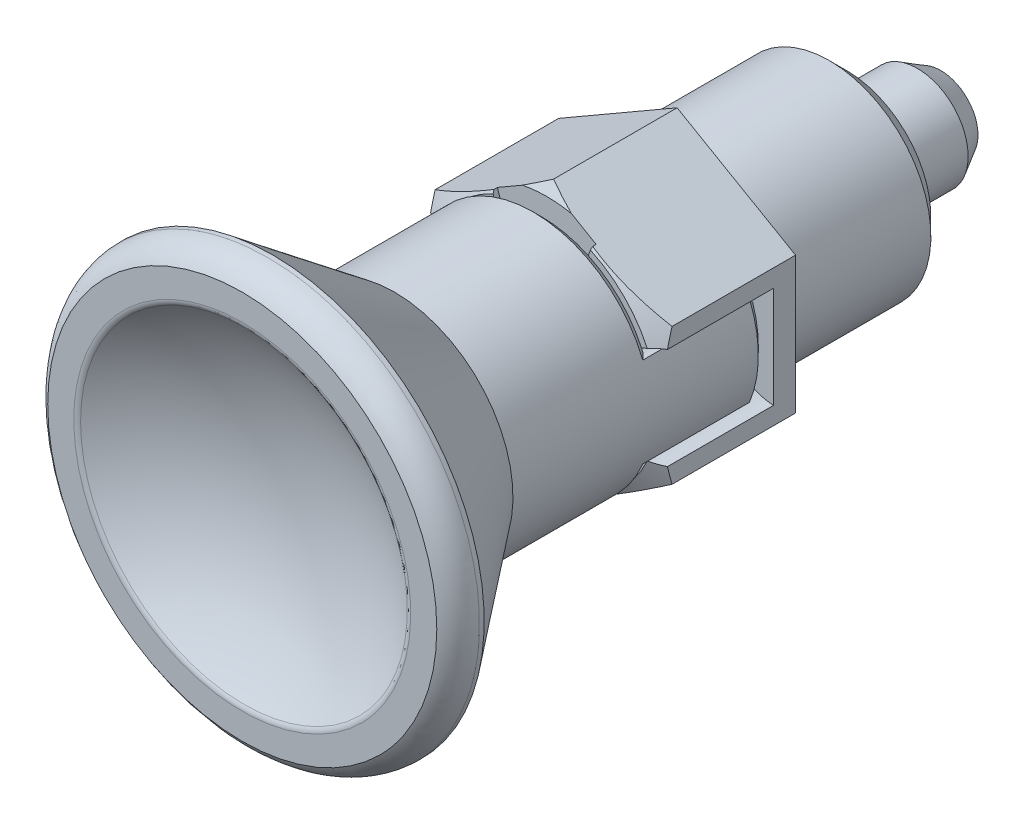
ISO-10303-21;
HEADER;
FILE_DESCRIPTION(('STEP AP214'),'2;1');
FILE_NAME('part.step','',(''),(''),'','','');
FILE_SCHEMA(('AUTOMOTIVE_DESIGN { 1 0 10303 214 1 1 1 1 }'));
ENDSEC;
DATA;
#1=APPLICATION_CONTEXT('core data for automotive mechanical design processes');
#2=APPLICATION_PROTOCOL_DEFINITION('international standard','automotive_design',2000,#1);
#3=PRODUCT_CONTEXT('',#1,'mechanical');
#4=PRODUCT('Part','Part','',(#3));
#5=PRODUCT_RELATED_PRODUCT_CATEGORY('part','',(#4));
#6=PRODUCT_DEFINITION_FORMATION('','',#4);
#7=PRODUCT_DEFINITION_CONTEXT('part definition',#1,'design');
#8=PRODUCT_DEFINITION('design','',#6,#7);
#9=PRODUCT_DEFINITION_SHAPE('','',#8);
#10=(LENGTH_UNIT() NAMED_UNIT(*) SI_UNIT(.MILLI.,.METRE.));
#11=(NAMED_UNIT(*) PLANE_ANGLE_UNIT() SI_UNIT($,.RADIAN.));
#12=(NAMED_UNIT(*) SI_UNIT($,.STERADIAN.) SOLID_ANGLE_UNIT());
#13=UNCERTAINTY_MEASURE_WITH_UNIT(LENGTH_MEASURE(1.E-05),#10,'distance_accuracy_value','');
#14=(GEOMETRIC_REPRESENTATION_CONTEXT(3) GLOBAL_UNCERTAINTY_ASSIGNED_CONTEXT((#13)) GLOBAL_UNIT_ASSIGNED_CONTEXT((#10,
#11,#12)) REPRESENTATION_CONTEXT('',''));
#15=CARTESIAN_POINT('',(0.,0.,0.));
#16=DIRECTION('',(0.,0.,1.));
#17=DIRECTION('',(1.,0.,0.));
#18=AXIS2_PLACEMENT_3D('',#15,#16,#17);
#19=CARTESIAN_POINT('',(0.,0.,20.));
#20=DIRECTION('',(0.,0.,-1.));
#21=DIRECTION('',(0.,1.,0.));
#22=AXIS2_PLACEMENT_3D('',#19,#20,#21);
#23=CYLINDRICAL_SURFACE('',#22,5.);
#24=CARTESIAN_POINT('',(0.,0.,8.));
#25=DIRECTION('',(0.,0.,-1.));
#26=DIRECTION('',(1.,0.,0.));
#27=AXIS2_PLACEMENT_3D('',#24,#25,#26);
#28=CIRCLE('',#27,5.);
#29=CARTESIAN_POINT('',(1.76859001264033,4.67676056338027,8.));
#30=VERTEX_POINT('',#29);
#31=CARTESIAN_POINT('',(-1.76859001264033,4.67676056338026,8.));
#32=VERTEX_POINT('',#31);
#33=EDGE_CURVE('E9',#30,#32,#28,.F.);
#34=ORIENTED_EDGE('',*,*,#33,.F.);
#35=DIRECTION('',(0.,0.,-1.));
#36=VECTOR('',#35,1.);
#37=CARTESIAN_POINT('',(1.76859001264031,4.67676056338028,7.85));
#38=LINE('',#37,#36);
#39=CARTESIAN_POINT('',(1.76859001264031,4.67676056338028,7.7));
#40=VERTEX_POINT('',#39);
#41=EDGE_CURVE('E802',#30,#40,#38,.T.);
#42=ORIENTED_EDGE('',*,*,#41,.T.);
#43=CARTESIAN_POINT('',(0.,0.,7.7));
#44=DIRECTION('',(0.,0.,-1.));
#45=DIRECTION('',(0.,1.,0.));
#46=AXIS2_PLACEMENT_3D('',#43,#44,#45);
#47=CIRCLE('',#46,5.);
#48=CARTESIAN_POINT('',(-1.76859001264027,4.67676056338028,7.7));
#49=VERTEX_POINT('',#48);
#50=EDGE_CURVE('E806',#40,#49,#47,.F.);
#51=ORIENTED_EDGE('',*,*,#50,.T.);
#52=DIRECTION('',(0.,0.,-1.));
#53=VECTOR('',#52,1.);
#54=CARTESIAN_POINT('',(-1.76859001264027,4.67676056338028,7.85));
#55=LINE('',#54,#53);
#56=EDGE_CURVE('E662',#49,#32,#55,.F.);
#57=ORIENTED_EDGE('',*,*,#56,.T.);
#58=EDGE_LOOP('',(#34,#42,#51,#57));
#59=FACE_BOUND('',#58,.T.);
#60=ADVANCED_FACE('F15',(#59),#23,.T.);
#61=CARTESIAN_POINT('',(-1.76859001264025,-4.67676056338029,8.));
#62=VERTEX_POINT('',#61);
#63=CARTESIAN_POINT('',(1.76859001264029,-4.67676056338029,8.));
#64=VERTEX_POINT('',#63);
#65=EDGE_CURVE('E27',#62,#64,#28,.F.);
#66=ORIENTED_EDGE('',*,*,#65,.F.);
#67=DIRECTION('',(0.,0.,-1.));
#68=VECTOR('',#67,1.);
#69=CARTESIAN_POINT('',(-1.76859001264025,-4.67676056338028,7.85));
#70=LINE('',#69,#68);
#71=CARTESIAN_POINT('',(-1.76859001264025,-4.67676056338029,7.7));
#72=VERTEX_POINT('',#71);
#73=EDGE_CURVE('E770',#62,#72,#70,.T.);
#74=ORIENTED_EDGE('',*,*,#73,.T.);
#75=CARTESIAN_POINT('',(0.,0.,7.7));
#76=DIRECTION('',(0.,0.,-1.));
#77=DIRECTION('',(0.,1.,0.));
#78=AXIS2_PLACEMENT_3D('',#75,#76,#77);
#79=CIRCLE('',#78,5.);
#80=CARTESIAN_POINT('',(1.76859001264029,-4.67676056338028,7.7));
#81=VERTEX_POINT('',#80);
#82=EDGE_CURVE('E741',#72,#81,#79,.F.);
#83=ORIENTED_EDGE('',*,*,#82,.T.);
#84=DIRECTION('',(0.,0.,-1.));
#85=VECTOR('',#84,1.);
#86=CARTESIAN_POINT('',(1.76859001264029,-4.67676056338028,7.85));
#87=LINE('',#86,#85);
#88=EDGE_CURVE('E774',#81,#64,#87,.F.);
#89=ORIENTED_EDGE('',*,*,#88,.T.);
#90=EDGE_LOOP('',(#66,#74,#83,#89));
#91=FACE_BOUND('',#90,.T.);
#92=ADVANCED_FACE('F1258',(#91),#23,.T.);
#93=CARTESIAN_POINT('',(-4.67676056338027,1.76859001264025,8.));
#94=VERTEX_POINT('',#93);
#95=CARTESIAN_POINT('',(-4.74910071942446,1.56398285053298,8.));
#96=VERTEX_POINT('',#95);
#97=EDGE_CURVE('E392',#94,#96,#28,.F.);
#98=ORIENTED_EDGE('',*,*,#97,.F.);
#99=DIRECTION('',(0.,0.,-1.));
#100=VECTOR('',#99,1.);
#101=CARTESIAN_POINT('',(-4.67676056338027,1.76859001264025,4.65));
#102=LINE('',#101,#100);
#103=CARTESIAN_POINT('',(-4.67676056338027,1.76859001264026,1.3));
#104=VERTEX_POINT('',#103);
#105=EDGE_CURVE('E798',#94,#104,#102,.T.);
#106=ORIENTED_EDGE('',*,*,#105,.T.);
#107=CARTESIAN_POINT('',(0.,0.,1.3));
#108=DIRECTION('',(0.,0.,-1.));
#109=DIRECTION('',(0.,1.,0.));
#110=AXIS2_PLACEMENT_3D('',#107,#108,#109);
#111=CIRCLE('',#110,5.);
#112=CARTESIAN_POINT('',(-4.67676056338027,-1.76859001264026,1.3));
#113=VERTEX_POINT('',#112);
#114=EDGE_CURVE('E794',#104,#113,#111,.F.);
#115=ORIENTED_EDGE('',*,*,#114,.T.);
#116=DIRECTION('',(0.,0.,-1.));
#117=VECTOR('',#116,1.);
#118=CARTESIAN_POINT('',(-4.67676056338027,-1.76859001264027,4.65));
#119=LINE('',#118,#117);
#120=CARTESIAN_POINT('',(-4.67676056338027,-1.76859001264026,8.));
#121=VERTEX_POINT('',#120);
#122=EDGE_CURVE('E786',#113,#121,#119,.F.);
#123=ORIENTED_EDGE('',*,*,#122,.T.);
#124=CARTESIAN_POINT('',(-4.74910071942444,-1.56398285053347,8.));
#125=VERTEX_POINT('',#124);
#126=EDGE_CURVE('E715',#125,#121,#28,.F.);
#127=ORIENTED_EDGE('',*,*,#126,.F.);
#128=DIRECTION('',(0.,0.,-1.));
#129=VECTOR('',#128,1.);
#130=CARTESIAN_POINT('',(-4.74910071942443,-1.56398285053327,5.36889999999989));
#131=LINE('',#130,#129);
#132=CARTESIAN_POINT('',(-4.749100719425,-1.56398285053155,2.2));
#133=VERTEX_POINT('',#132);
#134=EDGE_CURVE('E709',#133,#125,#131,.F.);
#135=ORIENTED_EDGE('',*,*,#134,.F.);
#136=CARTESIAN_POINT('',(-4.93264865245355,-0.817910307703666,1.67685179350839));
#137=CARTESIAN_POINT('',(-4.92678210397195,-0.853284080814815,1.69558420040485));
#138=CARTESIAN_POINT('',(-4.92060336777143,-0.888195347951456,1.71506674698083));
#139=CARTESIAN_POINT('',(-4.90765869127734,-0.957140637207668,1.75531520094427));
#140=CARTESIAN_POINT('',(-4.90089299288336,-0.991175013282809,1.77608057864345));
#141=CARTESIAN_POINT('',(-4.87981264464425,-1.09184282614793,1.83985140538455));
#142=CARTESIAN_POINT('',(-4.86467336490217,-1.15728656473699,1.88446502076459));
#143=CARTESIAN_POINT('',(-4.83240748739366,-1.28538061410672,1.97672334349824));
#144=CARTESIAN_POINT('',(-4.81528226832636,-1.34803282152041,2.02436593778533));
#145=CARTESIAN_POINT('',(-4.77909341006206,-1.47117897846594,2.12212377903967));
#146=CARTESIAN_POINT('',(-4.76002324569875,-1.5316646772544,2.17224703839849));
#147=CARTESIAN_POINT('',(-4.74006934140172,-1.59114507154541,2.22314820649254));
#148=B_SPLINE_CURVE_WITH_KNOTS('',3,(#136,#137,#138,#139,#140,#141,#142,#143,#144,#145,#146,
#147),.UNSPECIFIED.,.F.,.F.,(4,2,2,2,2,4),(0.,0.121336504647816,0.242623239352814,
0.48435117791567,0.725912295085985,0.968312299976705),.UNSPECIFIED.);
#149=CARTESIAN_POINT('',(-4.9253597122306,-0.8607158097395,1.7));
#150=VERTEX_POINT('',#149);
#151=EDGE_CURVE('E692',#150,#133,#148,.T.);
#152=ORIENTED_EDGE('',*,*,#151,.F.);
#153=CARTESIAN_POINT('',(0.,0.,1.7));
#154=DIRECTION('',(0.,0.,-1.));
#155=DIRECTION('',(1.,0.,0.));
#156=AXIS2_PLACEMENT_3D('',#153,#154,#155);
#157=CIRCLE('',#156,5.);
#158=CARTESIAN_POINT('',(-4.92535971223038,0.860715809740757,1.7));
#159=VERTEX_POINT('',#158);
#160=EDGE_CURVE('E701',#159,#150,#157,.F.);
#161=ORIENTED_EDGE('',*,*,#160,.F.);
#162=CARTESIAN_POINT('',(-4.74006934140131,1.59114507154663,2.22314820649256));
#163=CARTESIAN_POINT('',(-4.76002324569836,1.53166467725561,2.17224703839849));
#164=CARTESIAN_POINT('',(-4.7790934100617,1.47117897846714,2.12212377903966));
#165=CARTESIAN_POINT('',(-4.81528226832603,1.34803282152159,2.0243659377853));
#166=CARTESIAN_POINT('',(-4.83240748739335,1.2853806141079,1.97672334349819));
#167=CARTESIAN_POINT('',(-4.8646733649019,1.15728656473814,1.88446502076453));
#168=CARTESIAN_POINT('',(-4.879812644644,1.09184282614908,1.83985140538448));
#169=CARTESIAN_POINT('',(-4.90089299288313,0.991175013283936,1.77608057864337));
#170=CARTESIAN_POINT('',(-4.90765869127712,0.957140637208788,1.75531520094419));
#171=CARTESIAN_POINT('',(-4.92060336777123,0.888195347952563,1.71506674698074));
#172=CARTESIAN_POINT('',(-4.92678210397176,0.853284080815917,1.69558420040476));
#173=CARTESIAN_POINT('',(-4.93264865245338,0.817910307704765,1.67685179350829));
#174=B_SPLINE_CURVE_WITH_KNOTS('',3,(#162,#163,#164,#165,#166,#167,#168,#169,#170,#171,#172,
#173),.UNSPECIFIED.,.F.,.F.,(4,2,2,2,2,4),(0.,0.242400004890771,0.483961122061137,
0.725689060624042,0.846975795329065,0.968312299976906),.UNSPECIFIED.);
#175=CARTESIAN_POINT('',(-4.7491007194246,1.56398285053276,2.2));
#176=VERTEX_POINT('',#175);
#177=EDGE_CURVE('E700',#176,#159,#174,.T.);
#178=ORIENTED_EDGE('',*,*,#177,.F.);
#179=DIRECTION('',(0.,0.,-1.));
#180=VECTOR('',#179,1.);
#181=CARTESIAN_POINT('',(-4.74910071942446,1.56398285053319,5.36890000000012));
#182=LINE('',#181,#180);
#183=EDGE_CURVE('E713',#96,#176,#182,.T.);
#184=ORIENTED_EDGE('',*,*,#183,.F.);
#185=EDGE_LOOP('',(#98,#106,#115,#123,#127,#135,#152,#161,#178,#184));
#186=FACE_BOUND('',#185,.T.);
#187=ADVANCED_FACE('F682',(#186),#23,.T.);
#188=CARTESIAN_POINT('',(-5.86020814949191,2.42466119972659,-10.));
#189=DIRECTION('',(0.,0.,-1.));
#190=DIRECTION('',(0.923728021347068,0.383049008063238,0.));
#191=AXIS2_PLACEMENT_3D('',#188,#189,#190);
#192=PLANE('',#191);
#193=CARTESIAN_POINT('',(0.,0.,-10.));
#194=DIRECTION('',(0.,0.,-1.));
#195=DIRECTION('',(0.923728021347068,0.383049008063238,0.));
#196=AXIS2_PLACEMENT_3D('',#193,#194,#195);
#197=CIRCLE('',#196,3.1);
#198=CARTESIAN_POINT('',(2.8635568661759,1.18745192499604,-10.));
#199=VERTEX_POINT('',#198);
#200=EDGE_CURVE('E737',#199,#199,#197,.T.);
#201=ORIENTED_EDGE('',*,*,#200,.F.);
#202=EDGE_LOOP('',(#201));
#203=FACE_BOUND('',#202,.T.);
#204=CARTESIAN_POINT('',(0.,0.,-10.));
#205=DIRECTION('',(0.,0.,-1.));
#206=DIRECTION('',(-1.,0.,0.));
#207=AXIS2_PLACEMENT_3D('',#204,#205,#206);
#208=CIRCLE('',#207,5.);
#209=CARTESIAN_POINT('',(-4.99999999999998,0.,-10.));
#210=VERTEX_POINT('',#209);
#211=EDGE_CURVE('E845',#210,#210,#208,.T.);
#212=ORIENTED_EDGE('',*,*,#211,.T.);
#213=EDGE_LOOP('',(#212));
#214=FACE_BOUND('',#213,.T.);
#215=ADVANCED_FACE('F685',(#203,#214),#192,.T.);
#216=CARTESIAN_POINT('',(0.,0.,-10.2));
#217=DIRECTION('',(0.,0.,-1.));
#218=DIRECTION('',(-1.,0.,0.));
#219=AXIS2_PLACEMENT_3D('',#216,#217,#218);
#220=TOROIDAL_SURFACE('',#219,3.10000000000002,0.200000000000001);
#221=ORIENTED_EDGE('',*,*,#200,.T.);
#222=EDGE_LOOP('',(#221));
#223=FACE_BOUND('',#222,.T.);
#224=CARTESIAN_POINT('',(0.,0.,-10.2));
#225=DIRECTION('',(0.,0.,-1.));
#226=DIRECTION('',(0.923728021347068,0.383049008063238,0.));
#227=AXIS2_PLACEMENT_3D('',#224,#225,#226);
#228=CIRCLE('',#227,2.9);
#229=CARTESIAN_POINT('',(2.67881126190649,1.11084212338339,-10.2));
#230=VERTEX_POINT('',#229);
#231=EDGE_CURVE('E742',#230,#230,#228,.T.);
#232=ORIENTED_EDGE('',*,*,#231,.F.);
#233=EDGE_LOOP('',(#232));
#234=FACE_BOUND('',#233,.T.);
#235=ADVANCED_FACE('F1249',(#223,#234),#220,.F.);
#236=CARTESIAN_POINT('',(0.,0.,-10.2));
#237=DIRECTION('',(0.,0.,-1.));
#238=DIRECTION('',(0.923728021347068,0.383049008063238,0.));
#239=AXIS2_PLACEMENT_3D('',#236,#237,#238);
#240=CYLINDRICAL_SURFACE('',#239,2.9);
#241=ORIENTED_EDGE('',*,*,#231,.T.);
#242=EDGE_LOOP('',(#241));
#243=FACE_BOUND('',#242,.T.);
#244=CARTESIAN_POINT('',(0.,0.,-10.2732050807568));
#245=DIRECTION('',(0.,0.,-1.));
#246=DIRECTION('',(0.923728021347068,0.383049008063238,0.));
#247=AXIS2_PLACEMENT_3D('',#244,#245,#246);
#248=CIRCLE('',#247,2.9);
#249=CARTESIAN_POINT('',(2.67881126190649,1.11084212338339,-10.2732050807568));
#250=VERTEX_POINT('',#249);
#251=EDGE_CURVE('E746',#250,#250,#248,.T.);
#252=ORIENTED_EDGE('',*,*,#251,.F.);
#253=EDGE_LOOP('',(#252));
#254=FACE_BOUND('',#253,.T.);
#255=ADVANCED_FACE('F1256',(#243,#254),#240,.T.);
#256=CARTESIAN_POINT('',(0.,0.,-10.2732050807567));
#257=DIRECTION('',(0.,0.,-1.));
#258=DIRECTION('',(-1.,0.,0.));
#259=AXIS2_PLACEMENT_3D('',#256,#257,#258);
#260=TOROIDAL_SURFACE('',#259,3.10000000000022,0.200000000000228);
#261=ORIENTED_EDGE('',*,*,#251,.T.);
#262=EDGE_LOOP('',(#261));
#263=FACE_BOUND('',#262,.T.);
#264=CARTESIAN_POINT('',(0.,0.,-10.3732050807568));
#265=DIRECTION('',(0.,0.,-1.));
#266=DIRECTION('',(0.923728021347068,0.383049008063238,0.));
#267=AXIS2_PLACEMENT_3D('',#264,#265,#266);
#268=CIRCLE('',#267,2.9267949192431);
#269=CARTESIAN_POINT('',(2.70356247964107,1.12110589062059,-10.3732050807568));
#270=VERTEX_POINT('',#269);
#271=EDGE_CURVE('E750',#270,#270,#268,.T.);
#272=ORIENTED_EDGE('',*,*,#271,.F.);
#273=EDGE_LOOP('',(#272));
#274=FACE_BOUND('',#273,.T.);
#275=ADVANCED_FACE('F17',(#263,#274),#260,.F.);
#276=CARTESIAN_POINT('',(0.,0.,-10.3732050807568));
#277=DIRECTION('',(0.,0.,-1.));
#278=DIRECTION('',(0.923728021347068,0.383049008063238,0.));
#279=AXIS2_PLACEMENT_3D('',#276,#277,#278);
#280=CONICAL_SURFACE('',#279,2.9267949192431,0.523598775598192);
#281=ORIENTED_EDGE('',*,*,#271,.T.);
#282=EDGE_LOOP('',(#281));
#283=FACE_BOUND('',#282,.T.);
#284=CARTESIAN_POINT('',(0.,0.,-10.5));
#285=DIRECTION('',(0.,0.,-1.));
#286=DIRECTION('',(0.923728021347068,0.383049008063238,0.));
#287=AXIS2_PLACEMENT_3D('',#284,#285,#286);
#288=CIRCLE('',#287,3.);
#289=CARTESIAN_POINT('',(2.7711840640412,1.14914702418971,-10.5));
#290=VERTEX_POINT('',#289);
#291=EDGE_CURVE('E754',#290,#290,#288,.T.);
#292=ORIENTED_EDGE('',*,*,#291,.F.);
#293=EDGE_LOOP('',(#292));
#294=FACE_BOUND('',#293,.T.);
#295=ADVANCED_FACE('F2497',(#283,#294),#280,.T.);
#296=CARTESIAN_POINT('',(0.,0.,-10.5));
#297=DIRECTION('',(0.,0.,-1.));
#298=DIRECTION('',(0.923728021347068,0.383049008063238,0.));
#299=AXIS2_PLACEMENT_3D('',#296,#297,#298);
#300=CYLINDRICAL_SURFACE('',#299,3.);
#301=ORIENTED_EDGE('',*,*,#291,.T.);
#302=EDGE_LOOP('',(#301));
#303=FACE_BOUND('',#302,.T.);
#304=CARTESIAN_POINT('',(0.,0.,-14.2));
#305=DIRECTION('',(0.,0.,-1.));
#306=DIRECTION('',(0.923728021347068,0.383049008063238,0.));
#307=AXIS2_PLACEMENT_3D('',#304,#305,#306);
#308=CIRCLE('',#307,3.);
#309=CARTESIAN_POINT('',(2.7711840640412,1.14914702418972,-14.2));
#310=VERTEX_POINT('',#309);
#311=EDGE_CURVE('E758',#310,#310,#308,.T.);
#312=ORIENTED_EDGE('',*,*,#311,.F.);
#313=EDGE_LOOP('',(#312));
#314=FACE_BOUND('',#313,.T.);
#315=ADVANCED_FACE('F2486',(#303,#314),#300,.T.);
#316=CARTESIAN_POINT('',(0.,0.,-15.5810746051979));
#317=DIRECTION('',(0.,0.,1.));
#318=DIRECTION('',(0.923728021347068,0.383049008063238,0.));
#319=AXIS2_PLACEMENT_3D('',#316,#317,#318);
#320=CONICAL_SURFACE('',#319,2.20263620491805,0.523598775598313);
#321=ORIENTED_EDGE('',*,*,#311,.T.);
#322=EDGE_LOOP('',(#321));
#323=FACE_BOUND('',#322,.T.);
#324=CARTESIAN_POINT('',(0.,0.,-15.5810746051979));
#325=DIRECTION('',(0.,0.,-1.));
#326=DIRECTION('',(0.923728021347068,0.383049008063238,0.));
#327=AXIS2_PLACEMENT_3D('',#324,#325,#326);
#328=CIRCLE('',#327,2.20263620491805);
#329=CARTESIAN_POINT('',(2.03463678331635,0.843717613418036,-15.5810746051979));
#330=VERTEX_POINT('',#329);
#331=EDGE_CURVE('E762',#330,#330,#328,.T.);
#332=ORIENTED_EDGE('',*,*,#331,.F.);
#333=EDGE_LOOP('',(#332));
#334=FACE_BOUND('',#333,.T.);
#335=ADVANCED_FACE('F2475',(#323,#334),#320,.T.);
#336=CARTESIAN_POINT('',(0.,0.,-10.));
#337=DIRECTION('',(0.,0.,-1.));
#338=DIRECTION('',(0.923728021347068,0.383049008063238,0.));
#339=AXIS2_PLACEMENT_3D('',#336,#337,#338);
#340=SPHERICAL_SURFACE('',#339,5.99999999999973);
#341=ORIENTED_EDGE('',*,*,#331,.T.);
#342=EDGE_LOOP('',(#341));
#343=FACE_BOUND('',#342,.T.);
#344=CARTESIAN_POINT('',(0.,0.,-16.));
#345=VERTEX_POINT('',#344);
#346=VERTEX_LOOP('',#345);
#347=FACE_BOUND('',#346,.T.);
#348=ADVANCED_FACE('F2465',(#343,#347),#340,.T.);
#349=CARTESIAN_POINT('',(7.24037558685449,-7.24037558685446,8.));
#350=DIRECTION('',(0.,0.,1.));
#351=DIRECTION('',(0.,1.,0.));
#352=AXIS2_PLACEMENT_3D('',#349,#350,#351);
#353=PLANE('',#352);
#354=CARTESIAN_POINT('',(0.,0.,8.));
#355=DIRECTION('',(0.,0.,-1.));
#356=DIRECTION('',(0.921555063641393,-0.388247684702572,0.));
#357=AXIS2_PLACEMENT_3D('',#354,#355,#356);
#358=CIRCLE('',#357,6.5);
#359=CARTESIAN_POINT('',(-2.74584174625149,-5.89154929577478,8.));
#360=VERTEX_POINT('',#359);
#361=CARTESIAN_POINT('',(-5.89154929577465,-2.74584174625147,8.));
#362=VERTEX_POINT('',#361);
#363=EDGE_CURVE('E1287',#360,#362,#358,.T.);
#364=ORIENTED_EDGE('',*,*,#363,.T.);
#365=CARTESIAN_POINT('',(-7.1,0.,8.));
#366=DIRECTION('',(0.,0.,-1.));
#367=DIRECTION('',(0.286541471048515,0.958067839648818,0.));
#368=AXIS2_PLACEMENT_3D('',#365,#366,#367);
#369=CIRCLE('',#368,3.);
#370=CARTESIAN_POINT('',(-6.24037558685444,-2.87420351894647,8.));
#371=VERTEX_POINT('',#370);
#372=EDGE_CURVE('E716',#362,#371,#369,.T.);
#373=ORIENTED_EDGE('',*,*,#372,.T.);
#374=CARTESIAN_POINT('',(1.22623841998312E-13,0.,7.99999999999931));
#375=DIRECTION('',(0.,0.,1.));
#376=DIRECTION('',(-0.908289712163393,-0.418341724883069,0.));
#377=AXIS2_PLACEMENT_3D('',#374,#375,#376);
#378=CIRCLE('',#377,6.87046820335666);
#379=CARTESIAN_POINT('',(-2.87420351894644,-6.24037558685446,8.));
#380=VERTEX_POINT('',#379);
#381=EDGE_CURVE('E720',#371,#380,#378,.T.);
#382=ORIENTED_EDGE('',*,*,#381,.T.);
#383=CARTESIAN_POINT('',(0.,-7.1,8.));
#384=DIRECTION('',(0.,0.,-1.));
#385=DIRECTION('',(-0.958067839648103,0.286541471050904,0.));
#386=AXIS2_PLACEMENT_3D('',#383,#384,#385);
#387=CIRCLE('',#386,3.);
#388=EDGE_CURVE('E1050',#380,#360,#387,.T.);
#389=ORIENTED_EDGE('',*,*,#388,.T.);
#390=EDGE_LOOP('',(#364,#373,#382,#389));
#391=FACE_BOUND('',#390,.T.);
#392=ADVANCED_FACE('F2344',(#391),#353,.T.);
#393=CARTESIAN_POINT('',(0.,0.,8.));
#394=DIRECTION('',(0.,0.,-1.));
#395=DIRECTION('',(-0.921555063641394,0.38824768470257,0.));
#396=AXIS2_PLACEMENT_3D('',#393,#394,#395);
#397=CIRCLE('',#396,6.5);
#398=CARTESIAN_POINT('',(-5.89154929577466,2.74584174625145,8.));
#399=VERTEX_POINT('',#398);
#400=CARTESIAN_POINT('',(-2.74584174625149,5.8915492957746,8.));
#401=VERTEX_POINT('',#400);
#402=EDGE_CURVE('E406',#399,#401,#397,.T.);
#403=ORIENTED_EDGE('',*,*,#402,.T.);
#404=CARTESIAN_POINT('',(0.,7.1,8.));
#405=DIRECTION('',(0.,0.,-1.));
#406=DIRECTION('',(0.958067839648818,-0.286541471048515,0.));
#407=AXIS2_PLACEMENT_3D('',#404,#405,#406);
#408=CIRCLE('',#407,3.00000000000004);
#409=CARTESIAN_POINT('',(-2.87420351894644,6.24037558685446,8.));
#410=VERTEX_POINT('',#409);
#411=EDGE_CURVE('E918',#401,#410,#408,.T.);
#412=ORIENTED_EDGE('',*,*,#411,.T.);
#413=CARTESIAN_POINT('',(0.,0.,8.));
#414=DIRECTION('',(0.,0.,1.));
#415=DIRECTION('',(-0.41834172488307,0.908289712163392,0.));
#416=AXIS2_PLACEMENT_3D('',#413,#414,#415);
#417=CIRCLE('',#416,6.87046820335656);
#418=CARTESIAN_POINT('',(-6.24037558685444,2.87420351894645,8.));
#419=VERTEX_POINT('',#418);
#420=EDGE_CURVE('E1085',#410,#419,#417,.T.);
#421=ORIENTED_EDGE('',*,*,#420,.T.);
#422=EDGE_CURVE('E724',#419,#399,#369,.T.);
#423=ORIENTED_EDGE('',*,*,#422,.T.);
#424=EDGE_LOOP('',(#403,#412,#421,#423));
#425=FACE_BOUND('',#424,.T.);
#426=ADVANCED_FACE('F2448',(#425),#353,.T.);
#427=CARTESIAN_POINT('',(0.,0.,8.));
#428=DIRECTION('',(0.,0.,-1.));
#429=DIRECTION('',(0.,1.,0.));
#430=AXIS2_PLACEMENT_3D('',#427,#428,#429);
#431=CIRCLE('',#430,6.5);
#432=CARTESIAN_POINT('',(2.74584174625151,5.89154929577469,8.));
#433=VERTEX_POINT('',#432);
#434=CARTESIAN_POINT('',(5.89154929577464,2.74584174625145,8.));
#435=VERTEX_POINT('',#434);
#436=EDGE_CURVE('E36',#433,#435,#431,.T.);
#437=ORIENTED_EDGE('',*,*,#436,.T.);
#438=CARTESIAN_POINT('',(7.1,0.,8.));
#439=DIRECTION('',(0.,0.,-1.));
#440=DIRECTION('',(-0.286541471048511,-0.958067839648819,0.));
#441=AXIS2_PLACEMENT_3D('',#438,#439,#440);
#442=CIRCLE('',#441,3.);
#443=CARTESIAN_POINT('',(6.24037558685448,2.87420351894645,8.));
#444=VERTEX_POINT('',#443);
#445=EDGE_CURVE('E19',#435,#444,#442,.T.);
#446=ORIENTED_EDGE('',*,*,#445,.T.);
#447=CARTESIAN_POINT('',(0.,0.,8.));
#448=DIRECTION('',(0.,0.,1.));
#449=DIRECTION('',(0.908289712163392,0.41834172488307,0.));
#450=AXIS2_PLACEMENT_3D('',#447,#448,#449);
#451=CIRCLE('',#450,6.87046820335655);
#452=CARTESIAN_POINT('',(2.87420351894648,6.24037558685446,8.));
#453=VERTEX_POINT('',#452);
#454=EDGE_CURVE('E917',#444,#453,#451,.T.);
#455=ORIENTED_EDGE('',*,*,#454,.T.);
#456=EDGE_CURVE('E914',#453,#433,#408,.T.);
#457=ORIENTED_EDGE('',*,*,#456,.T.);
#458=EDGE_LOOP('',(#437,#446,#455,#457));
#459=FACE_BOUND('',#458,.T.);
#460=ADVANCED_FACE('F1781',(#459),#353,.T.);
#461=CARTESIAN_POINT('',(7.1,0.,8.));
#462=DIRECTION('',(0.,0.,-1.));
#463=DIRECTION('',(0.293476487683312,-0.955966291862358,0.));
#464=AXIS2_PLACEMENT_3D('',#461,#462,#463);
#465=CYLINDRICAL_SURFACE('',#464,3.);
#466=DIRECTION('',(0.,0.,-1.));
#467=VECTOR('',#466,1.);
#468=CARTESIAN_POINT('',(4.67676056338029,1.7685900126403,4.65));
#469=LINE('',#468,#467);
#470=CARTESIAN_POINT('',(4.67676056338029,1.7685900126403,1.3));
#471=VERTEX_POINT('',#470);
#472=CARTESIAN_POINT('',(4.6767605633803,1.76859001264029,8.));
#473=VERTEX_POINT('',#472);
#474=EDGE_CURVE('E790',#471,#473,#469,.F.);
#475=ORIENTED_EDGE('',*,*,#474,.F.);
#476=CARTESIAN_POINT('',(7.1,0.,1.3));
#477=DIRECTION('',(0.,0.,1.));
#478=DIRECTION('',(-0.0333333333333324,0.999444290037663,0.));
#479=AXIS2_PLACEMENT_3D('',#476,#477,#478);
#480=CIRCLE('',#479,3.);
#481=CARTESIAN_POINT('',(7.,2.99833287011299,1.3));
#482=VERTEX_POINT('',#481);
#483=EDGE_CURVE('E841',#482,#471,#480,.T.);
#484=ORIENTED_EDGE('',*,*,#483,.F.);
#485=DIRECTION('',(0.,0.,1.));
#486=VECTOR('',#485,1.);
#487=CARTESIAN_POINT('',(7.,2.99833287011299,1.3));
#488=LINE('',#487,#486);
#489=CARTESIAN_POINT('',(7.,2.99833287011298,7.57007707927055));
#490=VERTEX_POINT('',#489);
#491=EDGE_CURVE('E1136',#482,#490,#488,.T.);
#492=ORIENTED_EDGE('',*,*,#491,.T.);
#493=CARTESIAN_POINT('',(7.,2.99833287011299,7.57007707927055));
#494=CARTESIAN_POINT('',(6.9714816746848,2.99738172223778,7.58543070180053));
#495=CARTESIAN_POINT('',(6.9430096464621,2.99602480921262,7.60084492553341));
#496=CARTESIAN_POINT('',(6.88507059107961,2.99243717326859,7.63238390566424));
#497=CARTESIAN_POINT('',(6.85560789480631,2.99017454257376,7.64851299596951));
#498=CARTESIAN_POINT('',(6.79571927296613,2.98468607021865,7.68148153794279));
#499=CARTESIAN_POINT('',(6.76529856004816,2.98142735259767,7.69832498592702));
#500=CARTESIAN_POINT('',(6.70353165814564,2.97385534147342,7.73272268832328));
#501=CARTESIAN_POINT('',(6.67219168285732,2.96950823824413,7.75028066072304));
#502=CARTESIAN_POINT('',(6.60863014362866,2.95966646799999,7.78610763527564));
#503=CARTESIAN_POINT('',(6.57641590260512,2.95413709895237,7.80438009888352));
#504=CARTESIAN_POINT('',(6.51115637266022,2.94183659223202,7.84163632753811));
#505=CARTESIAN_POINT('',(6.47811962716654,2.93502990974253,7.86062332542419));
#506=CARTESIAN_POINT('',(6.41127268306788,2.92007971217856,7.89930876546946));
#507=CARTESIAN_POINT('',(6.37747235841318,2.91189986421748,7.91901023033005));
#508=CARTESIAN_POINT('',(6.30916334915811,2.89410820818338,7.95912508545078));
#509=CARTESIAN_POINT('',(6.2746659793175,2.88445935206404,7.97954131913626));
#510=CARTESIAN_POINT('',(6.24037558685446,2.87420351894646,8.));
#511=B_SPLINE_CURVE_WITH_KNOTS('',3,(#493,#494,#495,#496,#497,#498,#499,#500,#501,#502,#503,
#504,#505,#506,#507,#508,#509,#510),.UNSPECIFIED.,.F.,.F.,(4,2,2,2,2,2,2,2,4),(0.,
0.0972052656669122,0.198188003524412,0.302949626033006,0.41149139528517,0.523814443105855,
0.639919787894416,0.759808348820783,0.883480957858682),.UNSPECIFIED.);
#512=EDGE_CURVE('E871',#490,#444,#511,.T.);
#513=ORIENTED_EDGE('',*,*,#512,.T.);
#514=ORIENTED_EDGE('',*,*,#445,.F.);
#515=EDGE_CURVE('E735',#473,#435,#442,.T.);
#516=ORIENTED_EDGE('',*,*,#515,.F.);
#517=EDGE_LOOP('',(#475,#484,#492,#513,#514,#516));
#518=FACE_BOUND('',#517,.T.);
#519=ADVANCED_FACE('F1112',(#518),#465,.F.);
#520=CARTESIAN_POINT('',(0.,7.1,8.));
#521=DIRECTION('',(0.,0.,-1.));
#522=DIRECTION('',(0.993109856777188,0.117187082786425,0.));
#523=AXIS2_PLACEMENT_3D('',#520,#521,#522);
#524=CYLINDRICAL_SURFACE('',#523,3.);
#525=ORIENTED_EDGE('',*,*,#56,.F.);
#526=CARTESIAN_POINT('',(0.,7.1,7.7));
#527=DIRECTION('',(0.,0.,-1.));
#528=DIRECTION('',(0.972302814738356,-0.233724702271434,0.));
#529=AXIS2_PLACEMENT_3D('',#526,#527,#528);
#530=CIRCLE('',#529,3.);
#531=CARTESIAN_POINT('',(-2.91690844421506,6.39882589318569,7.7));
#532=VERTEX_POINT('',#531);
#533=EDGE_CURVE('E922',#49,#532,#530,.T.);
#534=ORIENTED_EDGE('',*,*,#533,.T.);
#535=DIRECTION('',(0.,0.,-1.));
#536=VECTOR('',#535,1.);
#537=CARTESIAN_POINT('',(-2.91690844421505,6.39882589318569,7.90656290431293));
#538=LINE('',#537,#536);
#539=CARTESIAN_POINT('',(-2.91690844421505,6.3988258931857,7.90656290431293));
#540=VERTEX_POINT('',#539);
#541=EDGE_CURVE('E896',#540,#532,#538,.T.);
#542=ORIENTED_EDGE('',*,*,#541,.F.);
#543=CARTESIAN_POINT('',(-2.87420351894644,6.24037558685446,8.));
#544=CARTESIAN_POINT('',(-2.88987107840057,6.29276097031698,7.96874485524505));
#545=CARTESIAN_POINT('',(-2.90409027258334,6.34550609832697,7.93764268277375));
#546=CARTESIAN_POINT('',(-2.91690844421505,6.3988258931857,7.90656290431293));
#547=B_SPLINE_CURVE_WITH_KNOTS('',3,(#543,#544,#545,#546),.UNSPECIFIED.,.F.,.F.,(4,4),(0.,
0.308523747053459),.UNSPECIFIED.);
#548=EDGE_CURVE('E926',#410,#540,#547,.T.);
#549=ORIENTED_EDGE('',*,*,#548,.F.);
#550=ORIENTED_EDGE('',*,*,#411,.F.);
#551=EDGE_CURVE('E819',#32,#401,#408,.T.);
#552=ORIENTED_EDGE('',*,*,#551,.F.);
#553=EDGE_LOOP('',(#525,#534,#542,#549,#550,#552));
#554=FACE_BOUND('',#553,.T.);
#555=ADVANCED_FACE('F1524',(#554),#524,.F.);
#556=CARTESIAN_POINT('',(-7.1,0.,8.));
#557=DIRECTION('',(0.,0.,-1.));
#558=DIRECTION('',(0.,1.,0.));
#559=AXIS2_PLACEMENT_3D('',#556,#557,#558);
#560=CYLINDRICAL_SURFACE('',#559,3.);
#561=ORIENTED_EDGE('',*,*,#122,.F.);
#562=CARTESIAN_POINT('',(-7.1,0.,1.3));
#563=DIRECTION('',(0.,0.,1.));
#564=DIRECTION('',(0.0333333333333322,-0.999444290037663,0.));
#565=AXIS2_PLACEMENT_3D('',#562,#563,#564);
#566=CIRCLE('',#565,3.);
#567=CARTESIAN_POINT('',(-7.,-2.99833287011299,1.3));
#568=VERTEX_POINT('',#567);
#569=EDGE_CURVE('E942',#568,#113,#566,.T.);
#570=ORIENTED_EDGE('',*,*,#569,.F.);
#571=DIRECTION('',(0.,0.,1.));
#572=VECTOR('',#571,1.);
#573=CARTESIAN_POINT('',(-7.,-2.99833287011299,1.3));
#574=LINE('',#573,#572);
#575=CARTESIAN_POINT('',(-7.,-2.998332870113,7.57007707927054));
#576=VERTEX_POINT('',#575);
#577=EDGE_CURVE('E1209',#568,#576,#574,.T.);
#578=ORIENTED_EDGE('',*,*,#577,.T.);
#579=CARTESIAN_POINT('',(-7.,-2.998332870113,7.57007707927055));
#580=CARTESIAN_POINT('',(-6.971436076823,-2.99738020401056,7.5854570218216));
#581=CARTESIAN_POINT('',(-6.94291838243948,-2.99602046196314,7.60089735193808));
#582=CARTESIAN_POINT('',(-6.88490126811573,-2.99242532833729,7.63248114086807));
#583=CARTESIAN_POINT('',(-6.85540612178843,-2.99015836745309,7.64862886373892));
#584=CARTESIAN_POINT('',(-6.7954658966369,-2.98466042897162,7.68162727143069));
#585=CARTESIAN_POINT('',(-6.76502596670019,-2.98139693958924,7.69848189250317));
#586=CARTESIAN_POINT('',(-6.70323387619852,-2.97381569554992,7.73289452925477));
#587=CARTESIAN_POINT('',(-6.67188785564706,-2.96946452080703,7.75045621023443));
#588=CARTESIAN_POINT('',(-6.60832734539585,-2.95961610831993,7.78628318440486));
#589=CARTESIAN_POINT('',(-6.57612009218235,-2.95408458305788,7.80455189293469));
#590=CARTESIAN_POINT('',(-6.51088744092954,-2.94178252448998,7.84179318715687));
#591=CARTESIAN_POINT('',(-6.47787048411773,-2.93497688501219,7.86076896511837));
#592=CARTESIAN_POINT('',(-6.41107570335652,-2.92003285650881,7.89942453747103));
#593=CARTESIAN_POINT('',(-6.37730763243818,-2.91185859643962,7.9191073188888));
#594=CARTESIAN_POINT('',(-6.30907528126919,-2.89408357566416,7.95917736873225));
#595=CARTESIAN_POINT('',(-6.27462217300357,-2.88444625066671,7.97956744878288));
#596=CARTESIAN_POINT('',(-6.24037558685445,-2.87420351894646,8.));
#597=B_SPLINE_CURVE_WITH_KNOTS('',3,(#579,#580,#581,#582,#583,#584,#585,#586,#587,#588,#589,
#590,#591,#592,#593,#594,#595,#596),.UNSPECIFIED.,.F.,.F.,(4,2,2,2,2,2,2,2,4),(0.,
0.0973631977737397,0.198458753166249,0.303288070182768,0.411852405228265,0.524152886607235,
0.640190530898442,0.759966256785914,0.883480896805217),.UNSPECIFIED.);
#598=EDGE_CURVE('E957',#576,#371,#597,.T.);
#599=ORIENTED_EDGE('',*,*,#598,.T.);
#600=ORIENTED_EDGE('',*,*,#372,.F.);
#601=EDGE_CURVE('E719',#121,#362,#369,.T.);
#602=ORIENTED_EDGE('',*,*,#601,.F.);
#603=EDGE_LOOP('',(#561,#570,#578,#599,#600,#602));
#604=FACE_BOUND('',#603,.T.);
#605=ADVANCED_FACE('F1185',(#604),#560,.F.);
#606=CARTESIAN_POINT('',(0.,-7.1,8.));
#607=DIRECTION('',(0.,0.,-1.));
#608=DIRECTION('',(0.,1.,0.));
#609=AXIS2_PLACEMENT_3D('',#606,#607,#608);
#610=CYLINDRICAL_SURFACE('',#609,3.);
#611=ORIENTED_EDGE('',*,*,#88,.F.);
#612=CARTESIAN_POINT('',(0.,-7.1,7.7));
#613=DIRECTION('',(0.,0.,-1.));
#614=DIRECTION('',(0.,1.,0.));
#615=AXIS2_PLACEMENT_3D('',#612,#613,#614);
#616=CIRCLE('',#615,3.);
#617=CARTESIAN_POINT('',(2.91690844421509,-6.3988258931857,7.7));
#618=VERTEX_POINT('',#617);
#619=EDGE_CURVE('E1063',#81,#618,#616,.T.);
#620=ORIENTED_EDGE('',*,*,#619,.T.);
#621=DIRECTION('',(0.,0.,-1.));
#622=VECTOR('',#621,1.);
#623=CARTESIAN_POINT('',(2.91690844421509,-6.39882589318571,7.90656290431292));
#624=LINE('',#623,#622);
#625=CARTESIAN_POINT('',(2.91690844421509,-6.39882589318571,7.90656290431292));
#626=VERTEX_POINT('',#625);
#627=EDGE_CURVE('E1031',#626,#618,#624,.T.);
#628=ORIENTED_EDGE('',*,*,#627,.F.);
#629=CARTESIAN_POINT('',(2.87420351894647,-6.24037558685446,8.));
#630=CARTESIAN_POINT('',(2.88987050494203,-6.29275905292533,7.96874599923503));
#631=CARTESIAN_POINT('',(2.90409256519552,-6.34551515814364,7.93763737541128));
#632=CARTESIAN_POINT('',(2.91690844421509,-6.39882589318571,7.90656290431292));
#633=B_SPLINE_CURVE_WITH_KNOTS('',3,(#629,#630,#631,#632),.UNSPECIFIED.,.F.,.F.,(4,4),(0.,
0.308534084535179),.UNSPECIFIED.);
#634=CARTESIAN_POINT('',(2.87420351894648,-6.24037558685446,8.));
#635=VERTEX_POINT('',#634);
#636=EDGE_CURVE('E1038',#635,#626,#633,.T.);
#637=ORIENTED_EDGE('',*,*,#636,.F.);
#638=CARTESIAN_POINT('',(0.,-7.1,8.));
#639=DIRECTION('',(0.,0.,-1.));
#640=DIRECTION('',(0.,1.,0.));
#641=AXIS2_PLACEMENT_3D('',#638,#639,#640);
#642=CIRCLE('',#641,3.);
#643=CARTESIAN_POINT('',(2.74584174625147,-5.89154929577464,8.));
#644=VERTEX_POINT('',#643);
#645=EDGE_CURVE('E1051',#644,#635,#642,.T.);
#646=ORIENTED_EDGE('',*,*,#645,.F.);
#647=EDGE_CURVE('E1046',#64,#644,#642,.T.);
#648=ORIENTED_EDGE('',*,*,#647,.F.);
#649=EDGE_LOOP('',(#611,#620,#628,#637,#646,#648));
#650=FACE_BOUND('',#649,.T.);
#651=ADVANCED_FACE('F1494',(#650),#610,.F.);
#652=CARTESIAN_POINT('',(0.,0.,0.));
#653=DIRECTION('',(0.,0.,-1.));
#654=DIRECTION('',(0.,1.,0.));
#655=AXIS2_PLACEMENT_3D('',#652,#653,#654);
#656=CYLINDRICAL_SURFACE('',#655,6.);
#657=CARTESIAN_POINT('',(0.,0.,-9.));
#658=DIRECTION('',(0.,0.,-1.));
#659=DIRECTION('',(-1.,0.,0.));
#660=AXIS2_PLACEMENT_3D('',#657,#658,#659);
#661=CIRCLE('',#660,6.);
#662=CARTESIAN_POINT('',(-5.99999999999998,0.,-9.));
#663=VERTEX_POINT('',#662);
#664=EDGE_CURVE('E766',#663,#663,#661,.F.);
#665=ORIENTED_EDGE('',*,*,#664,.T.);
#666=EDGE_LOOP('',(#665));
#667=FACE_BOUND('',#666,.T.);
#668=CARTESIAN_POINT('',(0.,0.,0.));
#669=DIRECTION('',(0.,0.,1.));
#670=DIRECTION('',(0.,1.,0.));
#671=AXIS2_PLACEMENT_3D('',#668,#669,#670);
#672=CIRCLE('',#671,6.);
#673=CARTESIAN_POINT('',(0.,6.,0.));
#674=VERTEX_POINT('',#673);
#675=EDGE_CURVE('E890',#674,#674,#672,.T.);
#676=ORIENTED_EDGE('',*,*,#675,.F.);
#677=EDGE_LOOP('',(#676));
#678=FACE_BOUND('',#677,.T.);
#679=ADVANCED_FACE('F683',(#667,#678),#656,.T.);
#680=CARTESIAN_POINT('',(3.94999980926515,-3.14999977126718,1.3));
#681=DIRECTION('',(0.,0.,-1.));
#682=DIRECTION('',(0.,1.,0.));
#683=AXIS2_PLACEMENT_3D('',#680,#681,#682);
#684=PLANE('',#683);
#685=CARTESIAN_POINT('',(0.,0.,1.3));
#686=DIRECTION('',(0.,0.,-1.));
#687=DIRECTION('',(0.,1.,0.));
#688=AXIS2_PLACEMENT_3D('',#685,#686,#687);
#689=CIRCLE('',#688,5.);
#690=CARTESIAN_POINT('',(4.67676056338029,-1.76859001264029,1.3));
#691=VERTEX_POINT('',#690);
#692=EDGE_CURVE('E782',#691,#471,#689,.F.);
#693=ORIENTED_EDGE('',*,*,#692,.F.);
#694=CARTESIAN_POINT('',(7.,-2.99833287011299,1.3));
#695=VERTEX_POINT('',#694);
#696=EDGE_CURVE('E846',#691,#695,#480,.T.);
#697=ORIENTED_EDGE('',*,*,#696,.T.);
#698=DIRECTION('',(0.,1.,0.));
#699=VECTOR('',#698,1.);
#700=CARTESIAN_POINT('',(7.,-2.99833287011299,1.3));
#701=LINE('',#700,#699);
#702=EDGE_CURVE('E847',#695,#482,#701,.T.);
#703=ORIENTED_EDGE('',*,*,#702,.T.);
#704=ORIENTED_EDGE('',*,*,#483,.T.);
#705=EDGE_LOOP('',(#693,#697,#703,#704));
#706=FACE_BOUND('',#705,.T.);
#707=ADVANCED_FACE('F1824',(#706),#684,.F.);
#708=CARTESIAN_POINT('',(7.,-4.04145188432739,8.));
#709=DIRECTION('',(-1.,0.,0.));
#710=DIRECTION('',(0.,1.,0.));
#711=AXIS2_PLACEMENT_3D('',#708,#709,#710);
#712=PLANE('',#711);
#713=ORIENTED_EDGE('',*,*,#702,.F.);
#714=DIRECTION('',(0.,0.,-1.));
#715=VECTOR('',#714,1.);
#716=CARTESIAN_POINT('',(7.,-2.998332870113,7.57007707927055));
#717=LINE('',#716,#715);
#718=CARTESIAN_POINT('',(7.,-2.99833287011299,7.57007707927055));
#719=VERTEX_POINT('',#718);
#720=EDGE_CURVE('E1144',#719,#695,#717,.T.);
#721=ORIENTED_EDGE('',*,*,#720,.F.);
#722=CARTESIAN_POINT('',(7.00000000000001,-2.99833287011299,7.57007707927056));
#723=CARTESIAN_POINT('',(7.00000000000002,-3.50435036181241,7.45504785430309));
#724=CARTESIAN_POINT('',(7.,-4.04145188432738,7.3));
#725=(BOUNDED_CURVE() B_SPLINE_CURVE(2,(#722,#723,#724),.UNSPECIFIED.,.F.,
.F.) B_SPLINE_CURVE_WITH_KNOTS((3,3),(0.,0.117179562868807),
.UNSPECIFIED.) CURVE() GEOMETRIC_REPRESENTATION_ITEM() RATIONAL_B_SPLINE_CURVE((1.03200708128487,
1.01812774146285,1.)) REPRESENTATION_ITEM(''));
#726=CARTESIAN_POINT('',(7.,-4.04145188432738,7.3));
#727=VERTEX_POINT('',#726);
#728=EDGE_CURVE('E850',#719,#727,#725,.T.);
#729=ORIENTED_EDGE('',*,*,#728,.T.);
#730=DIRECTION('',(0.,0.,-1.));
#731=VECTOR('',#730,1.);
#732=CARTESIAN_POINT('',(7.,-4.04145188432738,7.3));
#733=LINE('',#732,#731);
#734=CARTESIAN_POINT('',(7.,-4.04145188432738,0.));
#735=VERTEX_POINT('',#734);
#736=EDGE_CURVE('E851',#727,#735,#733,.T.);
#737=ORIENTED_EDGE('',*,*,#736,.T.);
#738=DIRECTION('',(0.,-1.,0.));
#739=VECTOR('',#738,1.);
#740=CARTESIAN_POINT('',(7.,4.04145188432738,0.));
#741=LINE('',#740,#739);
#742=CARTESIAN_POINT('',(7.,4.04145188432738,0.));
#743=VERTEX_POINT('',#742);
#744=EDGE_CURVE('E856',#743,#735,#741,.T.);
#745=ORIENTED_EDGE('',*,*,#744,.F.);
#746=DIRECTION('',(0.,0.,1.));
#747=VECTOR('',#746,1.);
#748=CARTESIAN_POINT('',(7.,4.04145188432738,0.));
#749=LINE('',#748,#747);
#750=CARTESIAN_POINT('',(7.,4.04145188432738,7.3));
#751=VERTEX_POINT('',#750);
#752=EDGE_CURVE('E855',#743,#751,#749,.T.);
#753=ORIENTED_EDGE('',*,*,#752,.T.);
#754=CARTESIAN_POINT('',(7.,4.04145188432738,7.3));
#755=CARTESIAN_POINT('',(7.00000000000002,3.50435036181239,7.4550478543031));
#756=CARTESIAN_POINT('',(7.00000000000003,2.99833287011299,7.57007707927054));
#757=(BOUNDED_CURVE() B_SPLINE_CURVE(2,(#754,#755,#756),.UNSPECIFIED.,.F.,
.F.) B_SPLINE_CURVE_WITH_KNOTS((3,3),(0.882820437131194,1.),
.UNSPECIFIED.) CURVE() GEOMETRIC_REPRESENTATION_ITEM() RATIONAL_B_SPLINE_CURVE((1.,
1.01812774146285,1.03200708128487)) REPRESENTATION_ITEM(''));
#758=EDGE_CURVE('E864',#751,#490,#757,.T.);
#759=ORIENTED_EDGE('',*,*,#758,.T.);
#760=ORIENTED_EDGE('',*,*,#491,.F.);
#761=EDGE_LOOP('',(#713,#721,#729,#737,#745,#753,#759,#760));
#762=FACE_BOUND('',#761,.T.);
#763=ADVANCED_FACE('F1111',(#762),#712,.F.);
#764=DIRECTION('',(0.,0.,-1.));
#765=VECTOR('',#764,1.);
#766=CARTESIAN_POINT('',(4.6767605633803,-1.7685900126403,4.65));
#767=LINE('',#766,#765);
#768=CARTESIAN_POINT('',(4.6767605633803,-1.76859001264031,8.));
#769=VERTEX_POINT('',#768);
#770=EDGE_CURVE('E778',#769,#691,#767,.T.);
#771=ORIENTED_EDGE('',*,*,#770,.F.);
#772=CARTESIAN_POINT('',(7.1,0.,8.));
#773=DIRECTION('',(0.,0.,-1.));
#774=DIRECTION('',(1.,0.,0.));
#775=AXIS2_PLACEMENT_3D('',#772,#773,#774);
#776=CIRCLE('',#775,3.);
#777=CARTESIAN_POINT('',(5.89154929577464,-2.74584174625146,8.));
#778=VERTEX_POINT('',#777);
#779=EDGE_CURVE('E837',#769,#778,#776,.F.);
#780=ORIENTED_EDGE('',*,*,#779,.T.);
#781=CARTESIAN_POINT('',(6.24037558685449,-2.87420351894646,8.));
#782=VERTEX_POINT('',#781);
#783=EDGE_CURVE('E1447',#782,#778,#442,.T.);
#784=ORIENTED_EDGE('',*,*,#783,.F.);
#785=CARTESIAN_POINT('',(6.24037558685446,-2.87420351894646,8.));
#786=CARTESIAN_POINT('',(6.27462384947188,-2.88444675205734,7.97956644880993));
#787=CARTESIAN_POINT('',(6.30907865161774,-2.89408451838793,7.9591753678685));
#788=CARTESIAN_POINT('',(6.37731393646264,-2.91186017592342,7.91910360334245));
#789=CARTESIAN_POINT('',(6.41108324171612,-2.92003464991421,7.89942010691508));
#790=CARTESIAN_POINT('',(6.47788001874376,-2.93497891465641,7.86076339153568));
#791=CARTESIAN_POINT('',(6.51089773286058,-2.94178459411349,7.84178718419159));
#792=CARTESIAN_POINT('',(6.5761314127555,-2.95408659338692,7.80454531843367));
#793=CARTESIAN_POINT('',(6.60833893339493,-2.95961803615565,7.78627646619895));
#794=CARTESIAN_POINT('',(6.67189948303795,-2.96946619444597,7.75044949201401));
#795=CARTESIAN_POINT('',(6.7032452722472,-2.97381721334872,7.73288795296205));
#796=CARTESIAN_POINT('',(6.76503639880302,-2.98139810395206,7.69847588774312));
#797=CARTESIAN_POINT('',(6.79547559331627,-2.98466141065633,7.68162169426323));
#798=CARTESIAN_POINT('',(6.85541384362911,-2.99015898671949,7.64862442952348));
#799=CARTESIAN_POINT('',(6.88490774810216,-2.99242578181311,7.63247741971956));
#800=CARTESIAN_POINT('',(6.94292187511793,-2.99602062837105,7.60089534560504));
#801=CARTESIAN_POINT('',(6.97143782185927,-2.99738026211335,7.58545601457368));
#802=CARTESIAN_POINT('',(7.,-2.99833287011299,7.57007707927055));
#803=B_SPLINE_CURVE_WITH_KNOTS('',3,(#785,#786,#787,#788,#789,#790,#791,#792,#793,#794,#795,
#796,#797,#798,#799,#800,#801,#802),.UNSPECIFIED.,.F.,.F.,(4,2,2,2,2,2,2,2,4),(0.,
0.123520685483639,0.243300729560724,0.359340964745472,0.471642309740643,0.58020578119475,
0.6850325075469,0.786123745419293,0.883480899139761),.UNSPECIFIED.);
#804=EDGE_CURVE('E1094',#782,#719,#803,.T.);
#805=ORIENTED_EDGE('',*,*,#804,.T.);
#806=ORIENTED_EDGE('',*,*,#720,.T.);
#807=ORIENTED_EDGE('',*,*,#696,.F.);
#808=EDGE_LOOP('',(#771,#780,#784,#805,#806,#807));
#809=FACE_BOUND('',#808,.T.);
#810=ADVANCED_FACE('F1100',(#809),#465,.F.);
#811=CARTESIAN_POINT('',(0.,0.,8.5));
#812=DIRECTION('',(0.,0.,-1.));
#813=DIRECTION('',(0.,1.,0.));
#814=AXIS2_PLACEMENT_3D('',#811,#812,#813);
#815=CONICAL_SURFACE('',#814,6.00444279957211,1.0471975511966);
#816=ORIENTED_EDGE('',*,*,#758,.F.);
#817=CARTESIAN_POINT('',(7.,4.04145188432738,7.3));
#818=CARTESIAN_POINT('',(4.81655454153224,5.30206470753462,8.02781515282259));
#819=CARTESIAN_POINT('',(2.91690844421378,6.39882589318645,7.90656290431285));
#820=(BOUNDED_CURVE() B_SPLINE_CURVE(2,(#817,#818,#819),.UNSPECIFIED.,.F.,
.F.) B_SPLINE_CURVE_WITH_KNOTS((3,3),(0.,0.589535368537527),
.UNSPECIFIED.) CURVE() GEOMETRIC_REPRESENTATION_ITEM() RATIONAL_B_SPLINE_CURVE((1.,
1.09120143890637,1.0748699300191)) REPRESENTATION_ITEM(''));
#821=CARTESIAN_POINT('',(2.9169084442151,6.3988258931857,7.90656290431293));
#822=VERTEX_POINT('',#821);
#823=EDGE_CURVE('E865',#751,#822,#820,.T.);
#824=ORIENTED_EDGE('',*,*,#823,.T.);
#825=CARTESIAN_POINT('',(2.9169084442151,6.3988258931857,7.90656290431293));
#826=CARTESIAN_POINT('',(2.90409091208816,6.34550823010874,7.93764140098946));
#827=CARTESIAN_POINT('',(2.88986801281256,6.29275072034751,7.96875097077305));
#828=CARTESIAN_POINT('',(2.87420351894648,6.24037558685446,8.));
#829=B_SPLINE_CURVE_WITH_KNOTS('',3,(#825,#826,#827,#828),.UNSPECIFIED.,.F.,.F.,(4,4),
(0.69135966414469,1.),.UNSPECIFIED.);
#830=EDGE_CURVE('E872',#822,#453,#829,.T.);
#831=ORIENTED_EDGE('',*,*,#830,.T.);
#832=ORIENTED_EDGE('',*,*,#454,.F.);
#833=ORIENTED_EDGE('',*,*,#512,.F.);
#834=EDGE_LOOP('',(#816,#824,#831,#832,#833));
#835=FACE_BOUND('',#834,.T.);
#836=ADVANCED_FACE('F1110',(#835),#815,.T.);
#837=CARTESIAN_POINT('',(7.,4.04145188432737,8.));
#838=DIRECTION('',(-0.5,-0.866025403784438,0.));
#839=DIRECTION('',(-0.866025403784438,0.5,0.));
#840=AXIS2_PLACEMENT_3D('',#837,#838,#839);
#841=PLANE('',#840);
#842=ORIENTED_EDGE('',*,*,#823,.F.);
#843=ORIENTED_EDGE('',*,*,#752,.F.);
#844=DIRECTION('',(0.866025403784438,-0.5,0.));
#845=VECTOR('',#844,1.);
#846=CARTESIAN_POINT('',(0.,8.08290376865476,0.));
#847=LINE('',#846,#845);
#848=CARTESIAN_POINT('',(0.,8.08290376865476,0.));
#849=VERTEX_POINT('',#848);
#850=EDGE_CURVE('E882',#849,#743,#847,.T.);
#851=ORIENTED_EDGE('',*,*,#850,.F.);
#852=DIRECTION('',(0.,0.,-1.));
#853=VECTOR('',#852,1.);
#854=CARTESIAN_POINT('',(0.,8.08290376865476,7.3));
#855=LINE('',#854,#853);
#856=CARTESIAN_POINT('',(0.,8.08290376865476,7.3));
#857=VERTEX_POINT('',#856);
#858=EDGE_CURVE('E891',#857,#849,#855,.T.);
#859=ORIENTED_EDGE('',*,*,#858,.F.);
#860=CARTESIAN_POINT('',(1.4481715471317,7.24680153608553,7.7));
#861=CARTESIAN_POINT('',(0.75650752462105,7.64613394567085,7.55216917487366));
#862=CARTESIAN_POINT('',(0.,8.08290376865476,7.3));
#863=(BOUNDED_CURVE() B_SPLINE_CURVE(2,(#860,#861,#862),.UNSPECIFIED.,.F.,
.F.) B_SPLINE_CURVE_WITH_KNOTS((3,3),(0.807230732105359,1.),
.UNSPECIFIED.) CURVE() GEOMETRIC_REPRESENTATION_ITEM() RATIONAL_B_SPLINE_CURVE((1.04814567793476,
1.02982150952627,1.)) REPRESENTATION_ITEM(''));
#864=CARTESIAN_POINT('',(1.4481715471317,7.24680153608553,7.7));
#865=VERTEX_POINT('',#864);
#866=EDGE_CURVE('E897',#865,#857,#863,.T.);
#867=ORIENTED_EDGE('',*,*,#866,.F.);
#868=DIRECTION('',(0.866025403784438,-0.5,0.));
#869=VECTOR('',#868,1.);
#870=CARTESIAN_POINT('',(1.4481715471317,7.24680153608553,7.7));
#871=LINE('',#870,#869);
#872=CARTESIAN_POINT('',(2.9169084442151,6.3988258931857,7.7));
#873=VERTEX_POINT('',#872);
#874=EDGE_CURVE('E881',#865,#873,#871,.T.);
#875=ORIENTED_EDGE('',*,*,#874,.T.);
#876=DIRECTION('',(0.,0.,1.));
#877=VECTOR('',#876,1.);
#878=CARTESIAN_POINT('',(2.9169084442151,6.3988258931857,7.7));
#879=LINE('',#878,#877);
#880=EDGE_CURVE('E909',#873,#822,#879,.T.);
#881=ORIENTED_EDGE('',*,*,#880,.T.);
#882=EDGE_LOOP('',(#842,#843,#851,#859,#867,#875,#881));
#883=FACE_BOUND('',#882,.T.);
#884=ADVANCED_FACE('F1514',(#883),#841,.F.);
#885=ORIENTED_EDGE('',*,*,#41,.F.);
#886=CARTESIAN_POINT('',(0.,7.1,8.));
#887=DIRECTION('',(0.,0.,-1.));
#888=DIRECTION('',(1.,0.,0.));
#889=AXIS2_PLACEMENT_3D('',#886,#887,#888);
#890=CIRCLE('',#889,3.);
#891=EDGE_CURVE('E408',#30,#433,#890,.F.);
#892=ORIENTED_EDGE('',*,*,#891,.T.);
#893=ORIENTED_EDGE('',*,*,#456,.F.);
#894=ORIENTED_EDGE('',*,*,#830,.F.);
#895=ORIENTED_EDGE('',*,*,#880,.F.);
#896=EDGE_CURVE('E913',#873,#40,#530,.T.);
#897=ORIENTED_EDGE('',*,*,#896,.T.);
#898=EDGE_LOOP('',(#885,#892,#893,#894,#895,#897));
#899=FACE_BOUND('',#898,.T.);
#900=ADVANCED_FACE('F1186',(#899),#524,.F.);
#901=ORIENTED_EDGE('',*,*,#420,.F.);
#902=ORIENTED_EDGE('',*,*,#548,.T.);
#903=CARTESIAN_POINT('',(-2.91690844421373,6.39882589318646,7.90656290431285));
#904=CARTESIAN_POINT('',(-4.81655454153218,5.30206470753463,8.0278151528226));
#905=CARTESIAN_POINT('',(-7.,4.04145188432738,7.3));
#906=(BOUNDED_CURVE() B_SPLINE_CURVE(2,(#903,#904,#905),.UNSPECIFIED.,.F.,
.F.) B_SPLINE_CURVE_WITH_KNOTS((3,3),(0.410464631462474,1.),
.UNSPECIFIED.) CURVE() GEOMETRIC_REPRESENTATION_ITEM() RATIONAL_B_SPLINE_CURVE((1.0748699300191,
1.09120143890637,1.)) REPRESENTATION_ITEM(''));
#907=CARTESIAN_POINT('',(-7.,4.04145188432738,7.3));
#908=VERTEX_POINT('',#907);
#909=EDGE_CURVE('E932',#540,#908,#906,.T.);
#910=ORIENTED_EDGE('',*,*,#909,.T.);
#911=CARTESIAN_POINT('',(-6.99999999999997,2.99833287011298,7.57007707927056));
#912=CARTESIAN_POINT('',(-6.99999999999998,3.5043503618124,7.4550478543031));
#913=CARTESIAN_POINT('',(-7.,4.04145188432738,7.3));
#914=(BOUNDED_CURVE() B_SPLINE_CURVE(2,(#911,#912,#913),.UNSPECIFIED.,.F.,
.F.) B_SPLINE_CURVE_WITH_KNOTS((3,3),(0.,0.117179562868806),
.UNSPECIFIED.) CURVE() GEOMETRIC_REPRESENTATION_ITEM() RATIONAL_B_SPLINE_CURVE((1.03200708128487,
1.01812774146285,1.)) REPRESENTATION_ITEM(''));
#915=CARTESIAN_POINT('',(-7.,2.99833287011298,7.57007707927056));
#916=VERTEX_POINT('',#915);
#917=EDGE_CURVE('E726',#916,#908,#914,.T.);
#918=ORIENTED_EDGE('',*,*,#917,.F.);
#919=CARTESIAN_POINT('',(-6.24037558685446,2.87420351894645,8.));
#920=CARTESIAN_POINT('',(-6.27466548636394,2.88445920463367,7.97954161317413));
#921=CARTESIAN_POINT('',(-6.30916235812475,2.8941079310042,7.9591256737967));
#922=CARTESIAN_POINT('',(-6.37747050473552,2.91189939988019,7.91901132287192));
#923=CARTESIAN_POINT('',(-6.4112704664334,2.92007918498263,7.89931006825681));
#924=CARTESIAN_POINT('',(-6.47811682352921,2.935029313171,7.860624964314));
#925=CARTESIAN_POINT('',(-6.51115334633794,2.94183598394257,7.84163809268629));
#926=CARTESIAN_POINT('',(-6.57641257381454,2.95413650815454,7.80438203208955));
#927=CARTESIAN_POINT('',(-6.6086267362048,2.95966590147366,7.78610961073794));
#928=CARTESIAN_POINT('',(-6.67218826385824,2.9695077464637,7.75028263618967));
#929=CARTESIAN_POINT('',(-6.70352830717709,2.9738548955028,7.73272462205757));
#930=CARTESIAN_POINT('',(-6.7652954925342,2.98142701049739,7.69832675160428));
#931=CARTESIAN_POINT('',(-6.79571642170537,2.98468578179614,7.68148317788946));
#932=CARTESIAN_POINT('',(-6.85560562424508,2.99017436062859,7.64851429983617));
#933=CARTESIAN_POINT('',(-6.88506868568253,2.99243704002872,7.63238499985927));
#934=CARTESIAN_POINT('',(-6.94300861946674,2.99602476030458,7.60084551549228));
#935=CARTESIAN_POINT('',(-6.97148116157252,2.99738170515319,7.58543099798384));
#936=CARTESIAN_POINT('',(-7.,2.99833287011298,7.57007707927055));
#937=B_SPLINE_CURVE_WITH_KNOTS('',3,(#919,#920,#921,#922,#923,#924,#925,#926,#927,#928,#929,
#930,#931,#932,#933,#934,#935,#936),.UNSPECIFIED.,.F.,.F.,(4,2,2,2,2,2,2,2,4),(0.,
0.123670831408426,0.243558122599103,0.359662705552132,0.471985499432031,0.580527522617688,
0.685289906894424,0.786273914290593,0.883480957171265),.UNSPECIFIED.);
#938=EDGE_CURVE('E941',#419,#916,#937,.T.);
#939=ORIENTED_EDGE('',*,*,#938,.F.);
#940=EDGE_LOOP('',(#901,#902,#910,#918,#939));
#941=FACE_BOUND('',#940,.T.);
#942=ADVANCED_FACE('F1184',(#941),#815,.T.);
#943=ORIENTED_EDGE('',*,*,#105,.F.);
#944=CARTESIAN_POINT('',(-7.1,0.,8.));
#945=DIRECTION('',(0.,0.,-1.));
#946=DIRECTION('',(1.,0.,0.));
#947=AXIS2_PLACEMENT_3D('',#944,#945,#946);
#948=CIRCLE('',#947,3.);
#949=EDGE_CURVE('E829',#94,#399,#948,.F.);
#950=ORIENTED_EDGE('',*,*,#949,.T.);
#951=ORIENTED_EDGE('',*,*,#422,.F.);
#952=ORIENTED_EDGE('',*,*,#938,.T.);
#953=DIRECTION('',(0.,0.,-1.));
#954=VECTOR('',#953,1.);
#955=CARTESIAN_POINT('',(-7.,2.99833287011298,7.57007707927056));
#956=LINE('',#955,#954);
#957=CARTESIAN_POINT('',(-7.,2.99833287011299,1.3));
#958=VERTEX_POINT('',#957);
#959=EDGE_CURVE('E1217',#916,#958,#956,.T.);
#960=ORIENTED_EDGE('',*,*,#959,.T.);
#961=EDGE_CURVE('E950',#104,#958,#566,.T.);
#962=ORIENTED_EDGE('',*,*,#961,.F.);
#963=EDGE_LOOP('',(#943,#950,#951,#952,#960,#962));
#964=FACE_BOUND('',#963,.T.);
#965=ADVANCED_FACE('F1173',(#964),#560,.F.);
#966=CARTESIAN_POINT('',(-7.,-4.04145188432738,7.3));
#967=CARTESIAN_POINT('',(-6.99999999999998,-3.50435036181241,7.45504785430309));
#968=CARTESIAN_POINT('',(-6.99999999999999,-2.998332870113,7.57007707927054));
#969=(BOUNDED_CURVE() B_SPLINE_CURVE(2,(#966,#967,#968),.UNSPECIFIED.,.F.,
.F.) B_SPLINE_CURVE_WITH_KNOTS((3,3),(0.882820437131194,1.),
.UNSPECIFIED.) CURVE() GEOMETRIC_REPRESENTATION_ITEM() RATIONAL_B_SPLINE_CURVE((1.,
1.01812774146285,1.03200708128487)) REPRESENTATION_ITEM(''));
#970=CARTESIAN_POINT('',(-7.,-4.04145188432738,7.3));
#971=VERTEX_POINT('',#970);
#972=EDGE_CURVE('E949',#971,#576,#969,.T.);
#973=ORIENTED_EDGE('',*,*,#972,.F.);
#974=CARTESIAN_POINT('',(-7.,-4.04145188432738,7.3));
#975=CARTESIAN_POINT('',(-4.81655454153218,-5.30206470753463,8.02781515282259));
#976=CARTESIAN_POINT('',(-2.91690844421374,-6.39882589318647,7.90656290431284));
#977=(BOUNDED_CURVE() B_SPLINE_CURVE(2,(#974,#975,#976),.UNSPECIFIED.,.F.,
.F.) B_SPLINE_CURVE_WITH_KNOTS((3,3),(0.,0.589535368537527),
.UNSPECIFIED.) CURVE() GEOMETRIC_REPRESENTATION_ITEM() RATIONAL_B_SPLINE_CURVE((1.,
1.09120143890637,1.0748699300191)) REPRESENTATION_ITEM(''));
#978=CARTESIAN_POINT('',(-2.91690844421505,-6.39882589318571,7.90656290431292));
#979=VERTEX_POINT('',#978);
#980=EDGE_CURVE('E951',#971,#979,#977,.T.);
#981=ORIENTED_EDGE('',*,*,#980,.T.);
#982=CARTESIAN_POINT('',(-2.91690844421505,-6.39882589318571,7.90656290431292));
#983=CARTESIAN_POINT('',(-2.90409401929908,-6.345520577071,7.93763417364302));
#984=CARTESIAN_POINT('',(-2.88986773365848,-6.29274978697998,7.9687515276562));
#985=CARTESIAN_POINT('',(-2.87420351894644,-6.24037558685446,8.));
#986=B_SPLINE_CURVE_WITH_KNOTS('',3,(#982,#983,#984,#985),.UNSPECIFIED.,.F.,.F.,(4,4),
(0.691365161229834,1.),.UNSPECIFIED.);
#987=EDGE_CURVE('E958',#979,#380,#986,.T.);
#988=ORIENTED_EDGE('',*,*,#987,.T.);
#989=ORIENTED_EDGE('',*,*,#381,.F.);
#990=ORIENTED_EDGE('',*,*,#598,.F.);
#991=EDGE_LOOP('',(#973,#981,#988,#989,#990));
#992=FACE_BOUND('',#991,.T.);
#993=ADVANCED_FACE('F1183',(#992),#815,.T.);
#994=CARTESIAN_POINT('',(-7.,4.04145188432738,8.));
#995=DIRECTION('',(1.,0.,0.));
#996=DIRECTION('',(0.,-1.,0.));
#997=AXIS2_PLACEMENT_3D('',#994,#995,#996);
#998=PLANE('',#997);
#999=DIRECTION('',(0.,-1.,0.));
#1000=VECTOR('',#999,1.);
#1001=CARTESIAN_POINT('',(-7.,2.99833287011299,1.3));
#1002=LINE('',#1001,#1000);
#1003=EDGE_CURVE('E967',#958,#568,#1002,.T.);
#1004=ORIENTED_EDGE('',*,*,#1003,.F.);
#1005=ORIENTED_EDGE('',*,*,#959,.F.);
#1006=ORIENTED_EDGE('',*,*,#917,.T.);
#1007=DIRECTION('',(0.,0.,-1.));
#1008=VECTOR('',#1007,1.);
#1009=CARTESIAN_POINT('',(-7.,4.04145188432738,7.3));
#1010=LINE('',#1009,#1008);
#1011=CARTESIAN_POINT('',(-7.,4.04145188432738,0.));
#1012=VERTEX_POINT('',#1011);
#1013=EDGE_CURVE('E974',#908,#1012,#1010,.T.);
#1014=ORIENTED_EDGE('',*,*,#1013,.T.);
#1015=DIRECTION('',(0.,1.,0.));
#1016=VECTOR('',#1015,1.);
#1017=CARTESIAN_POINT('',(-7.,-4.04145188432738,0.));
#1018=LINE('',#1017,#1016);
#1019=CARTESIAN_POINT('',(-7.,-4.04145188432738,0.));
#1020=VERTEX_POINT('',#1019);
#1021=EDGE_CURVE('E979',#1020,#1012,#1018,.T.);
#1022=ORIENTED_EDGE('',*,*,#1021,.F.);
#1023=DIRECTION('',(0.,0.,1.));
#1024=VECTOR('',#1023,1.);
#1025=CARTESIAN_POINT('',(-7.,-4.04145188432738,0.));
#1026=LINE('',#1025,#1024);
#1027=EDGE_CURVE('E978',#1020,#971,#1026,.T.);
#1028=ORIENTED_EDGE('',*,*,#1027,.T.);
#1029=ORIENTED_EDGE('',*,*,#972,.T.);
#1030=ORIENTED_EDGE('',*,*,#577,.F.);
#1031=EDGE_LOOP('',(#1004,#1005,#1006,#1014,#1022,#1028,#1029,#1030));
#1032=FACE_BOUND('',#1031,.T.);
#1033=ADVANCED_FACE('F1187',(#1032),#998,.F.);
#1034=CARTESIAN_POINT('',(-7.1,-3.14999977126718,1.3));
#1035=DIRECTION('',(0.,0.,-1.));
#1036=DIRECTION('',(0.,1.,0.));
#1037=AXIS2_PLACEMENT_3D('',#1034,#1035,#1036);
#1038=PLANE('',#1037);
#1039=ORIENTED_EDGE('',*,*,#114,.F.);
#1040=ORIENTED_EDGE('',*,*,#961,.T.);
#1041=ORIENTED_EDGE('',*,*,#1003,.T.);
#1042=ORIENTED_EDGE('',*,*,#569,.T.);
#1043=EDGE_LOOP('',(#1039,#1040,#1041,#1042));
#1044=FACE_BOUND('',#1043,.T.);
#1045=ADVANCED_FACE('F1530',(#1044),#1038,.F.);
#1046=CARTESIAN_POINT('',(0.,8.08290376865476,8.));
#1047=DIRECTION('',(0.5,-0.866025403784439,0.));
#1048=DIRECTION('',(-0.866025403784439,-0.5,0.));
#1049=AXIS2_PLACEMENT_3D('',#1046,#1047,#1048);
#1050=PLANE('',#1049);
#1051=DIRECTION('',(0.866025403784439,0.5,0.));
#1052=VECTOR('',#1051,1.);
#1053=CARTESIAN_POINT('',(-2.91690844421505,6.3988258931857,7.7));
#1054=LINE('',#1053,#1052);
#1055=CARTESIAN_POINT('',(-1.44817154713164,7.24680153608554,7.7));
#1056=VERTEX_POINT('',#1055);
#1057=EDGE_CURVE('E895',#532,#1056,#1054,.T.);
#1058=ORIENTED_EDGE('',*,*,#1057,.T.);
#1059=CARTESIAN_POINT('',(0.,8.08290376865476,7.3));
#1060=CARTESIAN_POINT('',(-0.756507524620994,7.64613394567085,7.55216917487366));
#1061=CARTESIAN_POINT('',(-1.44817154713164,7.24680153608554,7.7));
#1062=(BOUNDED_CURVE() B_SPLINE_CURVE(2,(#1059,#1060,#1061),.UNSPECIFIED.,.F.,
.F.) B_SPLINE_CURVE_WITH_KNOTS((3,3),(0.,0.192769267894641),
.UNSPECIFIED.) CURVE() GEOMETRIC_REPRESENTATION_ITEM() RATIONAL_B_SPLINE_CURVE((1.,
1.02982150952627,1.04814567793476)) REPRESENTATION_ITEM(''));
#1063=EDGE_CURVE('E902',#857,#1056,#1062,.T.);
#1064=ORIENTED_EDGE('',*,*,#1063,.F.);
#1065=ORIENTED_EDGE('',*,*,#858,.T.);
#1066=DIRECTION('',(0.866025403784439,0.5,0.));
#1067=VECTOR('',#1066,1.);
#1068=CARTESIAN_POINT('',(-7.,4.04145188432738,0.));
#1069=LINE('',#1068,#1067);
#1070=EDGE_CURVE('E889',#1012,#849,#1069,.T.);
#1071=ORIENTED_EDGE('',*,*,#1070,.F.);
#1072=ORIENTED_EDGE('',*,*,#1013,.F.);
#1073=ORIENTED_EDGE('',*,*,#909,.F.);
#1074=ORIENTED_EDGE('',*,*,#541,.T.);
#1075=EDGE_LOOP('',(#1058,#1064,#1065,#1071,#1072,#1073,#1074));
#1076=FACE_BOUND('',#1075,.T.);
#1077=ADVANCED_FACE('F1542',(#1076),#1050,.F.);
#1078=CARTESIAN_POINT('',(-3.14999977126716,3.95000027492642,7.7));
#1079=DIRECTION('',(0.,0.,-1.));
#1080=DIRECTION('',(0.,1.,0.));
#1081=AXIS2_PLACEMENT_3D('',#1078,#1079,#1080);
#1082=PLANE('',#1081);
#1083=ORIENTED_EDGE('',*,*,#50,.F.);
#1084=ORIENTED_EDGE('',*,*,#896,.F.);
#1085=ORIENTED_EDGE('',*,*,#874,.F.);
#1086=CARTESIAN_POINT('',(0.,-4.00575612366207E-11,7.7));
#1087=DIRECTION('',(0.,0.,-1.));
#1088=DIRECTION('',(0.,1.,0.));
#1089=AXIS2_PLACEMENT_3D('',#1086,#1087,#1088);
#1090=CIRCLE('',#1089,7.39008344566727);
#1091=CARTESIAN_POINT('',(0.,7.39008344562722,7.7));
#1092=VERTEX_POINT('',#1091);
#1093=EDGE_CURVE('E859',#1092,#865,#1090,.T.);
#1094=ORIENTED_EDGE('',*,*,#1093,.F.);
#1095=CARTESIAN_POINT('',(-1.18132098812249E-11,7.93521292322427E-11,7.7));
#1096=DIRECTION('',(0.,0.,-1.));
#1097=DIRECTION('',(-0.195961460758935,0.980611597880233,0.));
#1098=AXIS2_PLACEMENT_3D('',#1095,#1096,#1097);
#1099=CIRCLE('',#1098,7.39008344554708);
#1100=EDGE_CURVE('E993',#1056,#1092,#1099,.T.);
#1101=ORIENTED_EDGE('',*,*,#1100,.F.);
#1102=ORIENTED_EDGE('',*,*,#1057,.F.);
#1103=ORIENTED_EDGE('',*,*,#533,.F.);
#1104=EDGE_LOOP('',(#1083,#1084,#1085,#1094,#1101,#1102,#1103));
#1105=FACE_BOUND('',#1104,.T.);
#1106=ADVANCED_FACE('F1534',(#1105),#1082,.F.);
#1107=ORIENTED_EDGE('',*,*,#866,.T.);
#1108=ORIENTED_EDGE('',*,*,#1063,.T.);
#1109=ORIENTED_EDGE('',*,*,#1100,.T.);
#1110=ORIENTED_EDGE('',*,*,#1093,.T.);
#1111=EDGE_LOOP('',(#1107,#1108,#1109,#1110));
#1112=FACE_BOUND('',#1111,.T.);
#1113=ADVANCED_FACE('F1512',(#1112),#815,.T.);
#1114=CARTESIAN_POINT('',(-9.35,-9.35,0.));
#1115=DIRECTION('',(0.,0.,-1.));
#1116=DIRECTION('',(0.,1.,0.));
#1117=AXIS2_PLACEMENT_3D('',#1114,#1115,#1116);
#1118=PLANE('',#1117);
#1119=ORIENTED_EDGE('',*,*,#744,.T.);
#1120=DIRECTION('',(-0.866025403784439,-0.5,0.));
#1121=VECTOR('',#1120,1.);
#1122=CARTESIAN_POINT('',(7.,-4.04145188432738,0.));
#1123=LINE('',#1122,#1121);
#1124=CARTESIAN_POINT('',(0.,-8.08290376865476,0.));
#1125=VERTEX_POINT('',#1124);
#1126=EDGE_CURVE('E860',#735,#1125,#1123,.T.);
#1127=ORIENTED_EDGE('',*,*,#1126,.T.);
#1128=DIRECTION('',(-0.866025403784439,0.5,0.));
#1129=VECTOR('',#1128,1.);
#1130=CARTESIAN_POINT('',(0.,-8.08290376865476,0.));
#1131=LINE('',#1130,#1129);
#1132=EDGE_CURVE('E982',#1125,#1020,#1131,.T.);
#1133=ORIENTED_EDGE('',*,*,#1132,.T.);
#1134=ORIENTED_EDGE('',*,*,#1021,.T.);
#1135=ORIENTED_EDGE('',*,*,#1070,.T.);
#1136=ORIENTED_EDGE('',*,*,#850,.T.);
#1137=EDGE_LOOP('',(#1119,#1127,#1133,#1134,#1135,#1136));
#1138=FACE_BOUND('',#1137,.T.);
#1139=ORIENTED_EDGE('',*,*,#675,.T.);
#1140=EDGE_LOOP('',(#1139));
#1141=FACE_BOUND('',#1140,.T.);
#1142=ADVANCED_FACE('F1533',(#1138,#1141),#1118,.T.);
#1143=CARTESIAN_POINT('',(0.,-8.08290376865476,8.));
#1144=DIRECTION('',(-0.5,0.866025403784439,0.));
#1145=DIRECTION('',(0.866025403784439,0.5,0.));
#1146=AXIS2_PLACEMENT_3D('',#1143,#1144,#1145);
#1147=PLANE('',#1146);
#1148=DIRECTION('',(-0.866025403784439,-0.5,0.));
#1149=VECTOR('',#1148,1.);
#1150=CARTESIAN_POINT('',(2.91690844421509,-6.3988258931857,7.7));
#1151=LINE('',#1150,#1149);
#1152=CARTESIAN_POINT('',(1.44817154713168,-7.24680153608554,7.7));
#1153=VERTEX_POINT('',#1152);
#1154=EDGE_CURVE('E1014',#618,#1153,#1151,.T.);
#1155=ORIENTED_EDGE('',*,*,#1154,.T.);
#1156=CARTESIAN_POINT('',(0.,-8.08290376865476,7.3));
#1157=CARTESIAN_POINT('',(0.756507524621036,-7.64613394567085,7.55216917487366));
#1158=CARTESIAN_POINT('',(1.44817154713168,-7.24680153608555,7.7));
#1159=(BOUNDED_CURVE() B_SPLINE_CURVE(2,(#1156,#1157,#1158),.UNSPECIFIED.,.F.,
.F.) B_SPLINE_CURVE_WITH_KNOTS((3,3),(0.,0.19276926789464),
.UNSPECIFIED.) CURVE() GEOMETRIC_REPRESENTATION_ITEM() RATIONAL_B_SPLINE_CURVE((1.,
1.02982150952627,1.04814567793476)) REPRESENTATION_ITEM(''));
#1160=CARTESIAN_POINT('',(0.,-8.08290376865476,7.3));
#1161=VERTEX_POINT('',#1160);
#1162=EDGE_CURVE('E1019',#1161,#1153,#1159,.T.);
#1163=ORIENTED_EDGE('',*,*,#1162,.F.);
#1164=DIRECTION('',(0.,0.,-1.));
#1165=VECTOR('',#1164,1.);
#1166=CARTESIAN_POINT('',(0.,-8.08290376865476,7.3));
#1167=LINE('',#1166,#1165);
#1168=EDGE_CURVE('E1018',#1161,#1125,#1167,.T.);
#1169=ORIENTED_EDGE('',*,*,#1168,.T.);
#1170=ORIENTED_EDGE('',*,*,#1126,.F.);
#1171=ORIENTED_EDGE('',*,*,#736,.F.);
#1172=CARTESIAN_POINT('',(2.91690844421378,-6.39882589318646,7.90656290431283));
#1173=CARTESIAN_POINT('',(4.81655454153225,-5.30206470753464,8.02781515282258));
#1174=CARTESIAN_POINT('',(7.,-4.04145188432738,7.3));
#1175=(BOUNDED_CURVE() B_SPLINE_CURVE(2,(#1172,#1173,#1174),.UNSPECIFIED.,.F.,
.F.) B_SPLINE_CURVE_WITH_KNOTS((3,3),(0.410464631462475,1.),
.UNSPECIFIED.) CURVE() GEOMETRIC_REPRESENTATION_ITEM() RATIONAL_B_SPLINE_CURVE((1.0748699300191,
1.09120143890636,1.)) REPRESENTATION_ITEM(''));
#1176=EDGE_CURVE('E1032',#626,#727,#1175,.T.);
#1177=ORIENTED_EDGE('',*,*,#1176,.F.);
#1178=ORIENTED_EDGE('',*,*,#627,.T.);
#1179=EDGE_LOOP('',(#1155,#1163,#1169,#1170,#1171,#1177,#1178));
#1180=FACE_BOUND('',#1179,.T.);
#1181=ADVANCED_FACE('F1491',(#1180),#1147,.F.);
#1182=ORIENTED_EDGE('',*,*,#73,.F.);
#1183=CARTESIAN_POINT('',(0.,-7.1,8.));
#1184=DIRECTION('',(0.,0.,-1.));
#1185=DIRECTION('',(1.,0.,0.));
#1186=AXIS2_PLACEMENT_3D('',#1183,#1184,#1185);
#1187=CIRCLE('',#1186,3.);
#1188=EDGE_CURVE('E826',#62,#360,#1187,.F.);
#1189=ORIENTED_EDGE('',*,*,#1188,.T.);
#1190=ORIENTED_EDGE('',*,*,#388,.F.);
#1191=ORIENTED_EDGE('',*,*,#987,.F.);
#1192=DIRECTION('',(0.,0.,1.));
#1193=VECTOR('',#1192,1.);
#1194=CARTESIAN_POINT('',(-2.91690844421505,-6.3988258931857,7.7));
#1195=LINE('',#1194,#1193);
#1196=CARTESIAN_POINT('',(-2.91690844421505,-6.3988258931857,7.7));
#1197=VERTEX_POINT('',#1196);
#1198=EDGE_CURVE('E1055',#1197,#979,#1195,.T.);
#1199=ORIENTED_EDGE('',*,*,#1198,.F.);
#1200=CARTESIAN_POINT('',(0.,-7.1,7.7));
#1201=DIRECTION('',(0.,0.,-1.));
#1202=DIRECTION('',(-0.972302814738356,0.233724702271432,0.));
#1203=AXIS2_PLACEMENT_3D('',#1200,#1201,#1202);
#1204=CIRCLE('',#1203,3.);
#1205=EDGE_CURVE('E1045',#1197,#72,#1204,.T.);
#1206=ORIENTED_EDGE('',*,*,#1205,.T.);
#1207=EDGE_LOOP('',(#1182,#1189,#1190,#1191,#1199,#1206));
#1208=FACE_BOUND('',#1207,.T.);
#1209=ADVANCED_FACE('F1275',(#1208),#610,.F.);
#1210=CARTESIAN_POINT('',(0.,0.,8.));
#1211=DIRECTION('',(0.,0.,1.));
#1212=DIRECTION('',(0.41834172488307,-0.908289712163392,0.));
#1213=AXIS2_PLACEMENT_3D('',#1210,#1211,#1212);
#1214=CIRCLE('',#1213,6.87046820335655);
#1215=EDGE_CURVE('E1454',#635,#782,#1214,.T.);
#1216=ORIENTED_EDGE('',*,*,#1215,.F.);
#1217=ORIENTED_EDGE('',*,*,#636,.T.);
#1218=ORIENTED_EDGE('',*,*,#1176,.T.);
#1219=ORIENTED_EDGE('',*,*,#728,.F.);
#1220=ORIENTED_EDGE('',*,*,#804,.F.);
#1221=EDGE_LOOP('',(#1216,#1217,#1218,#1219,#1220));
#1222=FACE_BOUND('',#1221,.T.);
#1223=ADVANCED_FACE('F1487',(#1222),#815,.T.);
#1224=EDGE_CURVE('E1286',#778,#644,#358,.T.);
#1225=ORIENTED_EDGE('',*,*,#1224,.T.);
#1226=ORIENTED_EDGE('',*,*,#645,.T.);
#1227=ORIENTED_EDGE('',*,*,#1215,.T.);
#1228=ORIENTED_EDGE('',*,*,#783,.T.);
#1229=EDGE_LOOP('',(#1225,#1226,#1227,#1228));
#1230=FACE_BOUND('',#1229,.T.);
#1231=ADVANCED_FACE('F1451',(#1230),#353,.T.);
#1232=CARTESIAN_POINT('',(-7.,-4.04145188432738,8.));
#1233=DIRECTION('',(0.5,0.866025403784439,0.));
#1234=DIRECTION('',(0.866025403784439,-0.5,0.));
#1235=AXIS2_PLACEMENT_3D('',#1232,#1233,#1234);
#1236=PLANE('',#1235);
#1237=ORIENTED_EDGE('',*,*,#980,.F.);
#1238=ORIENTED_EDGE('',*,*,#1027,.F.);
#1239=ORIENTED_EDGE('',*,*,#1132,.F.);
#1240=ORIENTED_EDGE('',*,*,#1168,.F.);
#1241=CARTESIAN_POINT('',(-1.44817154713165,-7.24680153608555,7.7));
#1242=CARTESIAN_POINT('',(-0.756507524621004,-7.64613394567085,7.55216917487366));
#1243=CARTESIAN_POINT('',(0.,-8.08290376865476,7.3));
#1244=(BOUNDED_CURVE() B_SPLINE_CURVE(2,(#1241,#1242,#1243),.UNSPECIFIED.,.F.,
.F.) B_SPLINE_CURVE_WITH_KNOTS((3,3),(0.80723073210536,1.),
.UNSPECIFIED.) CURVE() GEOMETRIC_REPRESENTATION_ITEM() RATIONAL_B_SPLINE_CURVE((1.04814567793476,
1.02982150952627,1.)) REPRESENTATION_ITEM(''));
#1245=CARTESIAN_POINT('',(-1.44817154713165,-7.24680153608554,7.7));
#1246=VERTEX_POINT('',#1245);
#1247=EDGE_CURVE('E1024',#1246,#1161,#1244,.T.);
#1248=ORIENTED_EDGE('',*,*,#1247,.F.);
#1249=DIRECTION('',(-0.866025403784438,0.5,0.));
#1250=VECTOR('',#1249,1.);
#1251=CARTESIAN_POINT('',(-1.44817154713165,-7.24680153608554,7.7));
#1252=LINE('',#1251,#1250);
#1253=EDGE_CURVE('E1059',#1246,#1197,#1252,.T.);
#1254=ORIENTED_EDGE('',*,*,#1253,.T.);
#1255=ORIENTED_EDGE('',*,*,#1198,.T.);
#1256=EDGE_LOOP('',(#1237,#1238,#1239,#1240,#1248,#1254,#1255));
#1257=FACE_BOUND('',#1256,.T.);
#1258=ADVANCED_FACE('F1502',(#1257),#1236,.F.);
#1259=ORIENTED_EDGE('',*,*,#1247,.T.);
#1260=ORIENTED_EDGE('',*,*,#1162,.T.);
#1261=CARTESIAN_POINT('',(0.,0.,7.7));
#1262=DIRECTION('',(0.,0.,-1.));
#1263=DIRECTION('',(0.19596146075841,-0.980611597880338,0.));
#1264=AXIS2_PLACEMENT_3D('',#1261,#1262,#1263);
#1265=CIRCLE('',#1264,7.39008344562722);
#1266=EDGE_CURVE('E840',#1153,#1246,#1265,.T.);
#1267=ORIENTED_EDGE('',*,*,#1266,.T.);
#1268=EDGE_LOOP('',(#1259,#1260,#1267));
#1269=FACE_BOUND('',#1268,.T.);
#1270=ADVANCED_FACE('F1504',(#1269),#815,.T.);
#1271=CARTESIAN_POINT('',(-3.14999977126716,-7.62158680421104,7.7));
#1272=DIRECTION('',(0.,0.,-1.));
#1273=DIRECTION('',(0.,1.,0.));
#1274=AXIS2_PLACEMENT_3D('',#1271,#1272,#1273);
#1275=PLANE('',#1274);
#1276=ORIENTED_EDGE('',*,*,#82,.F.);
#1277=ORIENTED_EDGE('',*,*,#1205,.F.);
#1278=ORIENTED_EDGE('',*,*,#1253,.F.);
#1279=ORIENTED_EDGE('',*,*,#1266,.F.);
#1280=ORIENTED_EDGE('',*,*,#1154,.F.);
#1281=ORIENTED_EDGE('',*,*,#619,.F.);
#1282=EDGE_LOOP('',(#1276,#1277,#1278,#1279,#1280,#1281));
#1283=FACE_BOUND('',#1282,.T.);
#1284=ADVANCED_FACE('F1244',(#1283),#1275,.F.);
#1285=CARTESIAN_POINT('',(0.,0.,-10.));
#1286=DIRECTION('',(0.,0.,1.));
#1287=DIRECTION('',(1.,0.,0.));
#1288=AXIS2_PLACEMENT_3D('',#1285,#1286,#1287);
#1289=CONICAL_SURFACE('',#1288,5.,0.785398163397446);
#1290=ORIENTED_EDGE('',*,*,#664,.F.);
#1291=EDGE_LOOP('',(#1290));
#1292=FACE_BOUND('',#1291,.T.);
#1293=ORIENTED_EDGE('',*,*,#211,.F.);
#1294=EDGE_LOOP('',(#1293));
#1295=FACE_BOUND('',#1294,.T.);
#1296=ADVANCED_FACE('F681',(#1292,#1295),#1289,.T.);
#1297=CARTESIAN_POINT('',(4.74910071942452,1.56398285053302,8.));
#1298=VERTEX_POINT('',#1297);
#1299=EDGE_CURVE('E1422',#1298,#473,#28,.F.);
#1300=ORIENTED_EDGE('',*,*,#1299,.F.);
#1301=DIRECTION('',(0.,0.,-1.));
#1302=VECTOR('',#1301,1.);
#1303=CARTESIAN_POINT('',(4.74910071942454,1.56398285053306,5.3689));
#1304=LINE('',#1303,#1302);
#1305=CARTESIAN_POINT('',(4.74910071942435,1.56398285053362,2.2));
#1306=VERTEX_POINT('',#1305);
#1307=EDGE_CURVE('E660',#1306,#1298,#1304,.F.);
#1308=ORIENTED_EDGE('',*,*,#1307,.F.);
#1309=CARTESIAN_POINT('',(4.93264865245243,0.817910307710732,1.67685179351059));
#1310=CARTESIAN_POINT('',(4.92678210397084,0.853284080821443,1.69558420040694));
#1311=CARTESIAN_POINT('',(4.92060336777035,0.888195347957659,1.71506674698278));
#1312=CARTESIAN_POINT('',(4.90765869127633,0.957140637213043,1.75531520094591));
#1313=CARTESIAN_POINT('',(4.90089299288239,0.991175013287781,1.77608057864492));
#1314=CARTESIAN_POINT('',(4.87981264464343,1.09184282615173,1.83985140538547));
#1315=CARTESIAN_POINT('',(4.86467336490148,1.15728656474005,1.88446502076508));
#1316=CARTESIAN_POINT('',(4.83240748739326,1.28538061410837,1.97672334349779));
#1317=CARTESIAN_POINT('',(4.81528226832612,1.34803282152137,2.02436593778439));
#1318=CARTESIAN_POINT('',(4.7790934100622,1.4711789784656,2.12212377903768));
#1319=CARTESIAN_POINT('',(4.7600232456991,1.53166467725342,2.17224703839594));
#1320=CARTESIAN_POINT('',(4.7400693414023,1.59114507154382,2.22314820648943));
#1321=B_SPLINE_CURVE_WITH_KNOTS('',3,(#1309,#1310,#1311,#1312,#1313,#1314,#1315,#1316,#1317,
#1318,#1319,#1320),.UNSPECIFIED.,.F.,.F.,(4,2,2,2,2,4),(0.,0.121336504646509,0.242623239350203,
0.484351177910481,0.725912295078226,0.968312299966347),.UNSPECIFIED.);
#1322=CARTESIAN_POINT('',(4.92535971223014,0.860715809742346,1.7));
#1323=VERTEX_POINT('',#1322);
#1324=EDGE_CURVE('E650',#1323,#1306,#1321,.T.);
#1325=ORIENTED_EDGE('',*,*,#1324,.F.);
#1326=CARTESIAN_POINT('',(0.,0.,1.7));
#1327=DIRECTION('',(0.,0.,-1.));
#1328=DIRECTION('',(1.,0.,0.));
#1329=AXIS2_PLACEMENT_3D('',#1326,#1327,#1328);
#1330=CIRCLE('',#1329,5.);
#1331=CARTESIAN_POINT('',(4.92535971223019,-0.860715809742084,1.7));
#1332=VERTEX_POINT('',#1331);
#1333=EDGE_CURVE('E655',#1332,#1323,#1330,.F.);
#1334=ORIENTED_EDGE('',*,*,#1333,.F.);
#1335=CARTESIAN_POINT('',(4.74006934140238,-1.59114507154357,2.22314820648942));
#1336=CARTESIAN_POINT('',(4.76002324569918,-1.53166467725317,2.17224703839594));
#1337=CARTESIAN_POINT('',(4.77909341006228,-1.47117897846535,2.12212377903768));
#1338=CARTESIAN_POINT('',(4.81528226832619,-1.34803282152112,2.02436593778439));
#1339=CARTESIAN_POINT('',(4.83240748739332,-1.28538061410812,1.97672334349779));
#1340=CARTESIAN_POINT('',(4.86467336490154,-1.1572865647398,1.88446502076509));
#1341=CARTESIAN_POINT('',(4.87981264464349,-1.09184282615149,1.83985140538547));
#1342=CARTESIAN_POINT('',(4.90089299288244,-0.991175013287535,1.77608057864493));
#1343=CARTESIAN_POINT('',(4.90765869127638,-0.957140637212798,1.75531520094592));
#1344=CARTESIAN_POINT('',(4.92060336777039,-0.888195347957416,1.71506674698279));
#1345=CARTESIAN_POINT('',(4.92678210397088,-0.853284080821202,1.69558420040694));
#1346=CARTESIAN_POINT('',(4.93264865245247,-0.817910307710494,1.67685179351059));
#1347=B_SPLINE_CURVE_WITH_KNOTS('',3,(#1335,#1336,#1337,#1338,#1339,#1340,#1341,#1342,#1343,
#1344,#1345,#1346),.UNSPECIFIED.,.F.,.F.,(4,2,2,2,2,4),(0.,0.242400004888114,0.483961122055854,
0.725689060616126,0.846975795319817,0.968312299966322),.UNSPECIFIED.);
#1348=CARTESIAN_POINT('',(4.74910071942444,-1.56398285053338,2.2));
#1349=VERTEX_POINT('',#1348);
#1350=EDGE_CURVE('E654',#1349,#1332,#1347,.T.);
#1351=ORIENTED_EDGE('',*,*,#1350,.F.);
#1352=DIRECTION('',(0.,0.,-1.));
#1353=VECTOR('',#1352,1.);
#1354=CARTESIAN_POINT('',(4.74910071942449,-1.56398285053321,5.3689));
#1355=LINE('',#1354,#1353);
#1356=CARTESIAN_POINT('',(4.74910071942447,-1.56398285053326,8.));
#1357=VERTEX_POINT('',#1356);
#1358=EDGE_CURVE('E1414',#1357,#1349,#1355,.T.);
#1359=ORIENTED_EDGE('',*,*,#1358,.F.);
#1360=EDGE_CURVE('E29',#769,#1357,#28,.F.);
#1361=ORIENTED_EDGE('',*,*,#1360,.F.);
#1362=ORIENTED_EDGE('',*,*,#770,.T.);
#1363=ORIENTED_EDGE('',*,*,#692,.T.);
#1364=ORIENTED_EDGE('',*,*,#474,.T.);
#1365=EDGE_LOOP('',(#1300,#1308,#1325,#1334,#1351,#1359,#1361,#1362,#1363,#1364));
#1366=FACE_BOUND('',#1365,.T.);
#1367=ADVANCED_FACE('F675',(#1366),#23,.T.);
#1368=CARTESIAN_POINT('',(-7.7,-7.7,8.));
#1369=DIRECTION('',(0.,0.,-1.));
#1370=DIRECTION('',(0.,1.,0.));
#1371=AXIS2_PLACEMENT_3D('',#1368,#1369,#1370);
#1372=PLANE('',#1371);
#1373=ORIENTED_EDGE('',*,*,#515,.T.);
#1374=CARTESIAN_POINT('',(5.99010791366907,2.52360995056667,8.));
#1375=VERTEX_POINT('',#1374);
#1376=EDGE_CURVE('E1295',#435,#1375,#431,.T.);
#1377=ORIENTED_EDGE('',*,*,#1376,.T.);
#1378=CARTESIAN_POINT('',(6.95,0.,8.));
#1379=DIRECTION('',(0.,0.,-1.));
#1380=DIRECTION('',(-0.35551558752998,-0.934670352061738,0.));
#1381=AXIS2_PLACEMENT_3D('',#1378,#1379,#1380);
#1382=CIRCLE('',#1381,2.7);
#1383=EDGE_CURVE('E473',#1298,#1375,#1382,.T.);
#1384=ORIENTED_EDGE('',*,*,#1383,.F.);
#1385=ORIENTED_EDGE('',*,*,#1299,.T.);
#1386=EDGE_LOOP('',(#1373,#1377,#1384,#1385));
#1387=FACE_BOUND('',#1386,.T.);
#1388=ADVANCED_FACE('F680',(#1387),#1372,.T.);
#1389=ORIENTED_EDGE('',*,*,#551,.T.);
#1390=CARTESIAN_POINT('',(0.,6.5,8.));
#1391=VERTEX_POINT('',#1390);
#1392=EDGE_CURVE('E410',#401,#1391,#397,.T.);
#1393=ORIENTED_EDGE('',*,*,#1392,.T.);
#1394=EDGE_CURVE('E822',#1391,#433,#431,.T.);
#1395=ORIENTED_EDGE('',*,*,#1394,.T.);
#1396=ORIENTED_EDGE('',*,*,#891,.F.);
#1397=ORIENTED_EDGE('',*,*,#33,.T.);
#1398=EDGE_LOOP('',(#1389,#1393,#1395,#1396,#1397));
#1399=FACE_BOUND('',#1398,.T.);
#1400=ADVANCED_FACE('F818',(#1399),#1372,.T.);
#1401=ORIENTED_EDGE('',*,*,#601,.T.);
#1402=CARTESIAN_POINT('',(-5.99010791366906,-2.52360995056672,8.));
#1403=VERTEX_POINT('',#1402);
#1404=EDGE_CURVE('E421',#362,#1403,#358,.T.);
#1405=ORIENTED_EDGE('',*,*,#1404,.T.);
#1406=CARTESIAN_POINT('',(-6.95,0.,8.));
#1407=DIRECTION('',(0.,0.,-1.));
#1408=DIRECTION('',(0.355515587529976,0.93467035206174,0.));
#1409=AXIS2_PLACEMENT_3D('',#1406,#1407,#1408);
#1410=CIRCLE('',#1409,2.7);
#1411=EDGE_CURVE('E398',#125,#1403,#1410,.T.);
#1412=ORIENTED_EDGE('',*,*,#1411,.F.);
#1413=ORIENTED_EDGE('',*,*,#126,.T.);
#1414=EDGE_LOOP('',(#1401,#1405,#1412,#1413));
#1415=FACE_BOUND('',#1414,.T.);
#1416=ADVANCED_FACE('F1434',(#1415),#1372,.T.);
#1417=ORIENTED_EDGE('',*,*,#647,.T.);
#1418=EDGE_CURVE('E1281',#644,#360,#358,.T.);
#1419=ORIENTED_EDGE('',*,*,#1418,.T.);
#1420=ORIENTED_EDGE('',*,*,#1188,.F.);
#1421=ORIENTED_EDGE('',*,*,#65,.T.);
#1422=EDGE_LOOP('',(#1417,#1419,#1420,#1421));
#1423=FACE_BOUND('',#1422,.T.);
#1424=ADVANCED_FACE('F1279',(#1423),#1372,.T.);
#1425=ORIENTED_EDGE('',*,*,#779,.F.);
#1426=ORIENTED_EDGE('',*,*,#1360,.T.);
#1427=CARTESIAN_POINT('',(5.99010791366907,-2.52360995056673,8.));
#1428=VERTEX_POINT('',#1427);
#1429=EDGE_CURVE('E452',#1428,#1357,#1382,.T.);
#1430=ORIENTED_EDGE('',*,*,#1429,.F.);
#1431=EDGE_CURVE('E1291',#1428,#778,#358,.T.);
#1432=ORIENTED_EDGE('',*,*,#1431,.T.);
#1433=EDGE_LOOP('',(#1425,#1426,#1430,#1432));
#1434=FACE_BOUND('',#1433,.T.);
#1435=ADVANCED_FACE('F1444',(#1434),#1372,.T.);
#1436=ORIENTED_EDGE('',*,*,#949,.F.);
#1437=ORIENTED_EDGE('',*,*,#97,.T.);
#1438=CARTESIAN_POINT('',(-5.99010791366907,2.52360995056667,8.));
#1439=VERTEX_POINT('',#1438);
#1440=EDGE_CURVE('E387',#1439,#96,#1410,.T.);
#1441=ORIENTED_EDGE('',*,*,#1440,.F.);
#1442=EDGE_CURVE('E391',#1439,#399,#397,.T.);
#1443=ORIENTED_EDGE('',*,*,#1442,.T.);
#1444=EDGE_LOOP('',(#1436,#1437,#1441,#1443));
#1445=FACE_BOUND('',#1444,.T.);
#1446=ADVANCED_FACE('F390',(#1445),#1372,.T.);
#1447=CARTESIAN_POINT('',(-6.95,-3.11748463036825E-13,8.63000000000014));
#1448=DIRECTION('',(0.,0.,-1.));
#1449=DIRECTION('',(0.0385788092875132,0.999255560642,0.));
#1450=AXIS2_PLACEMENT_3D('',#1447,#1448,#1449);
#1451=CYLINDRICAL_SURFACE('',#1450,2.7);
#1452=ORIENTED_EDGE('',*,*,#1440,.T.);
#1453=ORIENTED_EDGE('',*,*,#183,.T.);
#1454=CARTESIAN_POINT('',(-6.95,8.86595116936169E-13,2.2));
#1455=DIRECTION('',(0.,0.,1.));
#1456=DIRECTION('',(0.175659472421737,-0.984450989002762,0.));
#1457=AXIS2_PLACEMENT_3D('',#1454,#1455,#1456);
#1458=CIRCLE('',#1457,2.6999999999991);
#1459=CARTESIAN_POINT('',(-6.47571942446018,2.65801767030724,2.2));
#1460=VERTEX_POINT('',#1459);
#1461=EDGE_CURVE('E832',#176,#1460,#1458,.T.);
#1462=ORIENTED_EDGE('',*,*,#1461,.T.);
#1463=DIRECTION('',(0.,0.,1.));
#1464=VECTOR('',#1463,1.);
#1465=CARTESIAN_POINT('',(-6.47571942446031,2.65801767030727,2.2));
#1466=LINE('',#1465,#1464);
#1467=CARTESIAN_POINT('',(-6.47571942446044,2.65801767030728,8.5));
#1468=VERTEX_POINT('',#1467);
#1469=EDGE_CURVE('E413',#1460,#1468,#1466,.T.);
#1470=ORIENTED_EDGE('',*,*,#1469,.T.);
#1471=CARTESIAN_POINT('',(-6.47571942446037,2.65801767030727,8.5));
#1472=CARTESIAN_POINT('',(-6.3091491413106,2.62829587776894,8.33461950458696));
#1473=CARTESIAN_POINT('',(-6.14652277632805,2.58310463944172,8.16724358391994));
#1474=CARTESIAN_POINT('',(-5.99010791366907,2.52360995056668,8.));
#1475=B_SPLINE_CURVE_WITH_KNOTS('',3,(#1471,#1472,#1473,#1474),.UNSPECIFIED.,.F.,.F.,(4,4),(0.,
0.000709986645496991),.UNSPECIFIED.);
#1476=EDGE_CURVE('E397',#1468,#1439,#1475,.T.);
#1477=ORIENTED_EDGE('',*,*,#1476,.T.);
#1478=EDGE_LOOP('',(#1452,#1453,#1462,#1470,#1477));
#1479=FACE_BOUND('',#1478,.T.);
#1480=ADVANCED_FACE('F411',(#1479),#1451,.T.);
#1481=CARTESIAN_POINT('',(6.95,-1.60549456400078E-13,8.63));
#1482=DIRECTION('',(0.,0.,-1.));
#1483=DIRECTION('',(-0.0452808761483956,-0.998974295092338,0.));
#1484=AXIS2_PLACEMENT_3D('',#1481,#1482,#1483);
#1485=CYLINDRICAL_SURFACE('',#1484,2.69999999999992);
#1486=ORIENTED_EDGE('',*,*,#1429,.T.);
#1487=ORIENTED_EDGE('',*,*,#1358,.T.);
#1488=CARTESIAN_POINT('',(6.95,1.78426778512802E-13,2.2));
#1489=DIRECTION('',(0.,0.,1.));
#1490=DIRECTION('',(-0.175659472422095,0.984450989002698,0.));
#1491=AXIS2_PLACEMENT_3D('',#1488,#1489,#1490);
#1492=CIRCLE('',#1491,2.70000000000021);
#1493=CARTESIAN_POINT('',(6.47571942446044,-2.6580176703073,2.2));
#1494=VERTEX_POINT('',#1493);
#1495=EDGE_CURVE('E607',#1349,#1494,#1492,.T.);
#1496=ORIENTED_EDGE('',*,*,#1495,.T.);
#1497=DIRECTION('',(0.,0.,1.));
#1498=VECTOR('',#1497,1.);
#1499=CARTESIAN_POINT('',(6.47571942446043,-2.65801767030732,2.2));
#1500=LINE('',#1499,#1498);
#1501=CARTESIAN_POINT('',(6.47571942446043,-2.65801767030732,8.5));
#1502=VERTEX_POINT('',#1501);
#1503=EDGE_CURVE('E451',#1494,#1502,#1500,.T.);
#1504=ORIENTED_EDGE('',*,*,#1503,.T.);
#1505=CARTESIAN_POINT('',(6.47571942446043,-2.65801767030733,8.5));
#1506=CARTESIAN_POINT('',(6.30914914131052,-2.62829587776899,8.33461950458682));
#1507=CARTESIAN_POINT('',(6.14652277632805,-2.58310463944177,8.16724358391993));
#1508=CARTESIAN_POINT('',(5.99010791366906,-2.52360995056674,8.));
#1509=B_SPLINE_CURVE_WITH_KNOTS('',3,(#1505,#1506,#1507,#1508),.UNSPECIFIED.,.F.,.F.,(4,4),(0.,
0.000709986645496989),.UNSPECIFIED.);
#1510=EDGE_CURVE('E442',#1502,#1428,#1509,.T.);
#1511=ORIENTED_EDGE('',*,*,#1510,.T.);
#1512=EDGE_LOOP('',(#1486,#1487,#1496,#1504,#1511));
#1513=FACE_BOUND('',#1512,.T.);
#1514=ADVANCED_FACE('F1417',(#1513),#1485,.T.);
#1515=CARTESIAN_POINT('',(-6.95,8.87535482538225E-13,1.7));
#1516=DIRECTION('',(0.,0.,1.));
#1517=DIRECTION('',(0.175659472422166,0.984450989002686,0.));
#1518=AXIS2_PLACEMENT_3D('',#1515,#1516,#1517);
#1519=CONICAL_SURFACE('',#1518,2.1999999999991,0.785398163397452);
#1520=ORIENTED_EDGE('',*,*,#1461,.F.);
#1521=ORIENTED_EDGE('',*,*,#177,.T.);
#1522=CARTESIAN_POINT('',(-6.95,8.87019901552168E-13,1.7));
#1523=DIRECTION('',(0.,0.,-1.));
#1524=DIRECTION('',(0.356196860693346,0.934410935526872,0.));
#1525=AXIS2_PLACEMENT_3D('',#1522,#1523,#1524);
#1526=CIRCLE('',#1525,2.1999999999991);
#1527=CARTESIAN_POINT('',(-6.16636690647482,2.05570405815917,1.7));
#1528=VERTEX_POINT('',#1527);
#1529=EDGE_CURVE('E1327',#1528,#159,#1526,.T.);
#1530=ORIENTED_EDGE('',*,*,#1529,.F.);
#1531=CARTESIAN_POINT('',(-6.16636690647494,2.05570405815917,1.70000000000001));
#1532=CARTESIAN_POINT('',(-6.17941300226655,2.08327277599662,1.72111041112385));
#1533=CARTESIAN_POINT('',(-6.19275542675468,2.1106548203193,1.74227720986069));
#1534=CARTESIAN_POINT('',(-6.21935479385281,2.16412766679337,1.78404364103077));
#1535=CARTESIAN_POINT('',(-6.23259825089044,2.19023002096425,1.80463705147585));
#1536=CARTESIAN_POINT('',(-6.25876009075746,2.24117120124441,1.84526484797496));
#1537=CARTESIAN_POINT('',(-6.27167169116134,2.26602033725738,1.8652907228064));
#1538=CARTESIAN_POINT('',(-6.2970465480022,2.31447663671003,1.90474730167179));
#1539=CARTESIAN_POINT('',(-6.30950650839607,2.33809298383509,1.9241687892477));
#1540=CARTESIAN_POINT('',(-6.33201473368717,2.38144605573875,1.9602769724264));
#1541=CARTESIAN_POINT('',(-6.34212960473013,2.40119826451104,1.97690340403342));
#1542=CARTESIAN_POINT('',(-6.3639290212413,2.44406103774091,2.01328971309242));
#1543=CARTESIAN_POINT('',(-6.37557893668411,2.4671552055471,2.03308936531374));
#1544=CARTESIAN_POINT('',(-6.40078904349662,2.51665148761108,2.0758118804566));
#1545=CARTESIAN_POINT('',(-6.41437162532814,2.54302554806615,2.09875412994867));
#1546=CARTESIAN_POINT('',(-6.44372634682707,2.59902471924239,2.14779097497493));
#1547=CARTESIAN_POINT('',(-6.45954855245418,2.62861335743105,2.17389717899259));
#1548=CARTESIAN_POINT('',(-6.47571942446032,2.65801767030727,2.20000000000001));
#1549=B_SPLINE_CURVE_WITH_KNOTS('',3,(#1531,#1532,#1533,#1534,#1535,#1536,#1537,#1538,#1539,
#1540,#1541,#1542,#1543,#1544,#1545,#1546,#1547,#1548),.UNSPECIFIED.,.F.,.F.,(4,2,2,2,2,2,2,2,
4),(0.,0.111273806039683,0.21863563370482,0.321915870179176,0.42096606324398,0.504150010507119,
0.601872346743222,0.71437692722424,0.841913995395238),.UNSPECIFIED.);
#1550=EDGE_CURVE('E1323',#1528,#1460,#1549,.T.);
#1551=ORIENTED_EDGE('',*,*,#1550,.T.);
#1552=EDGE_LOOP('',(#1520,#1521,#1530,#1551));
#1553=FACE_BOUND('',#1552,.T.);
#1554=ADVANCED_FACE('F1325',(#1553),#1519,.T.);
#1555=CARTESIAN_POINT('',(6.95,1.80562629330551E-13,1.7));
#1556=DIRECTION('',(0.,0.,1.));
#1557=DIRECTION('',(-0.175659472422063,-0.984450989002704,0.));
#1558=AXIS2_PLACEMENT_3D('',#1555,#1556,#1557);
#1559=CONICAL_SURFACE('',#1558,2.20000000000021,0.785398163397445);
#1560=ORIENTED_EDGE('',*,*,#1495,.F.);
#1561=ORIENTED_EDGE('',*,*,#1350,.T.);
#1562=CARTESIAN_POINT('',(6.95,1.85356776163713E-13,1.7));
#1563=DIRECTION('',(0.,0.,-1.));
#1564=DIRECTION('',(-0.356196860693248,-0.93441093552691,0.));
#1565=AXIS2_PLACEMENT_3D('',#1562,#1563,#1564);
#1566=CIRCLE('',#1565,2.20000000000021);
#1567=CARTESIAN_POINT('',(6.16636690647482,-2.0557040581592,1.7));
#1568=VERTEX_POINT('',#1567);
#1569=EDGE_CURVE('E614',#1568,#1332,#1566,.T.);
#1570=ORIENTED_EDGE('',*,*,#1569,.F.);
#1571=CARTESIAN_POINT('',(6.47571942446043,-2.65801767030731,2.20000000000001));
#1572=CARTESIAN_POINT('',(6.46649686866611,-2.64106380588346,2.18502957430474));
#1573=CARTESIAN_POINT('',(6.45743193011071,-2.62393120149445,2.17017059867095));
#1574=CARTESIAN_POINT('',(6.43685268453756,-2.58441240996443,2.13628142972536));
#1575=CARTESIAN_POINT('',(6.42539637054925,-2.56195346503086,2.11730064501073));
#1576=CARTESIAN_POINT('',(6.39989157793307,-2.51192385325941,2.07516928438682));
#1577=CARTESIAN_POINT('',(6.38583882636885,-2.48433806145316,2.0520396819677));
#1578=CARTESIAN_POINT('',(6.35497934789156,-2.42421848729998,2.00161774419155));
#1579=CARTESIAN_POINT('',(6.33813636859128,-2.39169681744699,1.97433301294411));
#1580=CARTESIAN_POINT('',(6.30595806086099,-2.33000965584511,1.92261591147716));
#1581=CARTESIAN_POINT('',(6.29064380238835,-2.30083953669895,1.89817593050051));
#1582=CARTESIAN_POINT('',(6.26157605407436,-2.24512552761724,1.85188086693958));
#1583=CARTESIAN_POINT('',(6.24781561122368,-2.218602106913,1.83000553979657));
#1584=CARTESIAN_POINT('',(6.22190183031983,-2.16812743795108,1.78881607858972));
#1585=CARTESIAN_POINT('',(6.20973369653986,-2.1442037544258,1.7694777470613));
#1586=CARTESIAN_POINT('',(6.18712697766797,-2.09879948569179,1.73339311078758));
#1587=CARTESIAN_POINT('',(6.1766540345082,-2.0773645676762,1.71661073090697));
#1588=CARTESIAN_POINT('',(6.16636690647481,-2.05570405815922,1.70000000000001));
#1589=B_SPLINE_CURVE_WITH_KNOTS('',3,(#1571,#1572,#1573,#1574,#1575,#1576,#1577,#1578,#1579,
#1580,#1581,#1582,#1583,#1584,#1585,#1586,#1587,#1588),.UNSPECIFIED.,.F.,.F.,(4,2,2,2,2,2,2,2,
4),(0.,0.0732695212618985,0.167941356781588,0.283876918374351,0.420887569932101,
0.543950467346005,0.655045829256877,0.754285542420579,0.841789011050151),.UNSPECIFIED.);
#1590=EDGE_CURVE('E595',#1494,#1568,#1589,.T.);
#1591=ORIENTED_EDGE('',*,*,#1590,.F.);
#1592=EDGE_LOOP('',(#1560,#1561,#1570,#1591));
#1593=FACE_BOUND('',#1592,.T.);
#1594=ADVANCED_FACE('F1412',(#1593),#1559,.T.);
#1595=CARTESIAN_POINT('',(0.,0.,8.));
#1596=DIRECTION('',(0.,0.,1.));
#1597=DIRECTION('',(-0.925102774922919,0.3797168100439,0.));
#1598=AXIS2_PLACEMENT_3D('',#1595,#1596,#1597);
#1599=CONICAL_SURFACE('',#1598,6.5,0.78539816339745);
#1600=ORIENTED_EDGE('',*,*,#1476,.F.);
#1601=CARTESIAN_POINT('',(0.,0.,8.5));
#1602=DIRECTION('',(0.,0.,1.));
#1603=DIRECTION('',(0.,1.,0.));
#1604=AXIS2_PLACEMENT_3D('',#1601,#1602,#1603);
#1605=CIRCLE('',#1604,7.);
#1606=CARTESIAN_POINT('',(0.,7.,8.5));
#1607=VERTEX_POINT('',#1606);
#1608=EDGE_CURVE('E427',#1607,#1468,#1605,.T.);
#1609=ORIENTED_EDGE('',*,*,#1608,.F.);
#1610=DIRECTION('',(0.,-0.707106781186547,-0.707106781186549));
#1611=VECTOR('',#1610,1.);
#1612=CARTESIAN_POINT('',(0.,7.,8.5));
#1613=LINE('',#1612,#1611);
#1614=EDGE_CURVE('E415',#1607,#1391,#1613,.T.);
#1615=ORIENTED_EDGE('',*,*,#1614,.T.);
#1616=ORIENTED_EDGE('',*,*,#1392,.F.);
#1617=ORIENTED_EDGE('',*,*,#402,.F.);
#1618=ORIENTED_EDGE('',*,*,#1442,.F.);
#1619=EDGE_LOOP('',(#1600,#1609,#1615,#1616,#1617,#1618));
#1620=FACE_BOUND('',#1619,.T.);
#1621=ADVANCED_FACE('F403',(#1620),#1599,.T.);
#1622=CARTESIAN_POINT('',(-6.47571942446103,-2.65801767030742,2.2));
#1623=VERTEX_POINT('',#1622);
#1624=EDGE_CURVE('E549',#1623,#133,#1458,.T.);
#1625=ORIENTED_EDGE('',*,*,#1624,.T.);
#1626=ORIENTED_EDGE('',*,*,#134,.T.);
#1627=ORIENTED_EDGE('',*,*,#1411,.T.);
#1628=CARTESIAN_POINT('',(-5.99010791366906,-2.52360995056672,8.));
#1629=CARTESIAN_POINT('',(-6.14652277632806,-2.58310463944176,8.16724358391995));
#1630=CARTESIAN_POINT('',(-6.30914914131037,-2.62829587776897,8.33461950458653));
#1631=CARTESIAN_POINT('',(-6.47571942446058,-2.65801767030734,8.5));
#1632=B_SPLINE_CURVE_WITH_KNOTS('',3,(#1628,#1629,#1630,#1631),.UNSPECIFIED.,.F.,.F.,(4,4),(0.,
0.000709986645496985),.UNSPECIFIED.);
#1633=CARTESIAN_POINT('',(-6.47571942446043,-2.65801767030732,8.5));
#1634=VERTEX_POINT('',#1633);
#1635=EDGE_CURVE('E435',#1403,#1634,#1632,.T.);
#1636=ORIENTED_EDGE('',*,*,#1635,.T.);
#1637=DIRECTION('',(0.,0.,-1.));
#1638=VECTOR('',#1637,1.);
#1639=CARTESIAN_POINT('',(-6.47571942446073,-2.65801767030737,8.5));
#1640=LINE('',#1639,#1638);
#1641=EDGE_CURVE('E441',#1634,#1623,#1640,.T.);
#1642=ORIENTED_EDGE('',*,*,#1641,.T.);
#1643=EDGE_LOOP('',(#1625,#1626,#1627,#1636,#1642));
#1644=FACE_BOUND('',#1643,.T.);
#1645=ADVANCED_FACE('F1437',(#1644),#1451,.T.);
#1646=CARTESIAN_POINT('',(0.,0.,8.));
#1647=DIRECTION('',(0.,0.,1.));
#1648=DIRECTION('',(0.925102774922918,-0.379716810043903,0.));
#1649=AXIS2_PLACEMENT_3D('',#1646,#1647,#1648);
#1650=CONICAL_SURFACE('',#1649,6.5,0.785398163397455);
#1651=ORIENTED_EDGE('',*,*,#1510,.F.);
#1652=CARTESIAN_POINT('',(0.,0.,8.5));
#1653=DIRECTION('',(0.,0.,1.));
#1654=DIRECTION('',(-0.925102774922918,-0.379716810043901,0.));
#1655=AXIS2_PLACEMENT_3D('',#1652,#1653,#1654);
#1656=CIRCLE('',#1655,7.);
#1657=EDGE_CURVE('E453',#1634,#1502,#1656,.T.);
#1658=ORIENTED_EDGE('',*,*,#1657,.F.);
#1659=ORIENTED_EDGE('',*,*,#1635,.F.);
#1660=ORIENTED_EDGE('',*,*,#1404,.F.);
#1661=ORIENTED_EDGE('',*,*,#363,.F.);
#1662=ORIENTED_EDGE('',*,*,#1418,.F.);
#1663=ORIENTED_EDGE('',*,*,#1224,.F.);
#1664=ORIENTED_EDGE('',*,*,#1431,.F.);
#1665=EDGE_LOOP('',(#1651,#1658,#1659,#1660,#1661,#1662,#1663,#1664));
#1666=FACE_BOUND('',#1665,.T.);
#1667=ADVANCED_FACE('F1442',(#1666),#1650,.T.);
#1668=CARTESIAN_POINT('',(6.4757194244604,2.65801767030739,2.2));
#1669=VERTEX_POINT('',#1668);
#1670=EDGE_CURVE('E626',#1669,#1306,#1492,.T.);
#1671=ORIENTED_EDGE('',*,*,#1670,.T.);
#1672=ORIENTED_EDGE('',*,*,#1307,.T.);
#1673=ORIENTED_EDGE('',*,*,#1383,.T.);
#1674=CARTESIAN_POINT('',(5.99010791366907,2.52360995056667,8.));
#1675=CARTESIAN_POINT('',(6.14652277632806,2.5831046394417,8.16724358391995));
#1676=CARTESIAN_POINT('',(6.30914914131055,2.62829587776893,8.33461950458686));
#1677=CARTESIAN_POINT('',(6.47571942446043,2.65801767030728,8.5));
#1678=B_SPLINE_CURVE_WITH_KNOTS('',3,(#1674,#1675,#1676,#1677),.UNSPECIFIED.,.F.,.F.,(4,4),(0.,
0.000709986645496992),.UNSPECIFIED.);
#1679=CARTESIAN_POINT('',(6.47571942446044,2.65801767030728,8.5));
#1680=VERTEX_POINT('',#1679);
#1681=EDGE_CURVE('E460',#1375,#1680,#1678,.T.);
#1682=ORIENTED_EDGE('',*,*,#1681,.T.);
#1683=DIRECTION('',(0.,0.,-1.));
#1684=VECTOR('',#1683,1.);
#1685=CARTESIAN_POINT('',(6.47571942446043,2.65801767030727,8.5));
#1686=LINE('',#1685,#1684);
#1687=EDGE_CURVE('E466',#1680,#1669,#1686,.T.);
#1688=ORIENTED_EDGE('',*,*,#1687,.T.);
#1689=EDGE_LOOP('',(#1671,#1672,#1673,#1682,#1688));
#1690=FACE_BOUND('',#1689,.T.);
#1691=ADVANCED_FACE('F637',(#1690),#1485,.T.);
#1692=CARTESIAN_POINT('',(0.,0.,8.));
#1693=DIRECTION('',(0.,0.,1.));
#1694=DIRECTION('',(0.,1.,0.));
#1695=AXIS2_PLACEMENT_3D('',#1692,#1693,#1694);
#1696=CONICAL_SURFACE('',#1695,6.5,0.785398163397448);
#1697=ORIENTED_EDGE('',*,*,#1614,.F.);
#1698=CARTESIAN_POINT('',(0.,0.,8.5));
#1699=DIRECTION('',(0.,0.,1.));
#1700=DIRECTION('',(0.925102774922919,0.379716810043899,0.));
#1701=AXIS2_PLACEMENT_3D('',#1698,#1699,#1700);
#1702=CIRCLE('',#1701,7.);
#1703=EDGE_CURVE('E432',#1680,#1607,#1702,.T.);
#1704=ORIENTED_EDGE('',*,*,#1703,.F.);
#1705=ORIENTED_EDGE('',*,*,#1681,.F.);
#1706=ORIENTED_EDGE('',*,*,#1376,.F.);
#1707=ORIENTED_EDGE('',*,*,#436,.F.);
#1708=ORIENTED_EDGE('',*,*,#1394,.F.);
#1709=EDGE_LOOP('',(#1697,#1704,#1705,#1706,#1707,#1708));
#1710=FACE_BOUND('',#1709,.T.);
#1711=ADVANCED_FACE('F1313',(#1710),#1696,.T.);
#1712=CARTESIAN_POINT('',(0.,0.,16.8));
#1713=DIRECTION('',(0.,0.,-1.));
#1714=DIRECTION('',(0.,1.,0.));
#1715=AXIS2_PLACEMENT_3D('',#1712,#1713,#1714);
#1716=CYLINDRICAL_SURFACE('',#1715,7.);
#1717=ORIENTED_EDGE('',*,*,#1687,.F.);
#1718=ORIENTED_EDGE('',*,*,#1703,.T.);
#1719=ORIENTED_EDGE('',*,*,#1608,.T.);
#1720=ORIENTED_EDGE('',*,*,#1469,.F.);
#1721=CARTESIAN_POINT('',(0.,0.,2.2));
#1722=DIRECTION('',(0.,0.,1.));
#1723=DIRECTION('',(-0.925102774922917,0.379716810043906,0.));
#1724=AXIS2_PLACEMENT_3D('',#1721,#1722,#1723);
#1725=CIRCLE('',#1724,7.);
#1726=EDGE_CURVE('E433',#1460,#1623,#1725,.T.);
#1727=ORIENTED_EDGE('',*,*,#1726,.T.);
#1728=ORIENTED_EDGE('',*,*,#1641,.F.);
#1729=ORIENTED_EDGE('',*,*,#1657,.T.);
#1730=ORIENTED_EDGE('',*,*,#1503,.F.);
#1731=CARTESIAN_POINT('',(0.,0.,2.2));
#1732=DIRECTION('',(0.,0.,1.));
#1733=DIRECTION('',(0.925102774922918,-0.379716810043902,0.));
#1734=AXIS2_PLACEMENT_3D('',#1731,#1732,#1733);
#1735=CIRCLE('',#1734,7.);
#1736=EDGE_CURVE('E459',#1494,#1669,#1735,.T.);
#1737=ORIENTED_EDGE('',*,*,#1736,.T.);
#1738=EDGE_LOOP('',(#1717,#1718,#1719,#1720,#1727,#1728,#1729,#1730,#1737));
#1739=FACE_BOUND('',#1738,.T.);
#1740=CARTESIAN_POINT('',(0.,0.,16.7));
#1741=DIRECTION('',(0.,0.,1.));
#1742=DIRECTION('',(0.,1.,0.));
#1743=AXIS2_PLACEMENT_3D('',#1740,#1741,#1742);
#1744=CIRCLE('',#1743,7.);
#1745=CARTESIAN_POINT('',(0.,6.99999999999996,16.7));
#1746=VERTEX_POINT('',#1745);
#1747=EDGE_CURVE('E474',#1746,#1746,#1744,.T.);
#1748=ORIENTED_EDGE('',*,*,#1747,.F.);
#1749=EDGE_LOOP('',(#1748));
#1750=FACE_BOUND('',#1749,.T.);
#1751=ADVANCED_FACE('F644',(#1739,#1750),#1716,.T.);
#1752=CARTESIAN_POINT('',(0.,0.,16.7));
#1753=DIRECTION('',(0.,0.,1.));
#1754=DIRECTION('',(0.,1.,0.));
#1755=AXIS2_PLACEMENT_3D('',#1752,#1753,#1754);
#1756=CONICAL_SURFACE('',#1755,7.,0.652330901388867);
#1757=CARTESIAN_POINT('',(0.,0.,23.9000000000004));
#1758=DIRECTION('',(0.,0.,1.));
#1759=DIRECTION('',(0.,1.,0.));
#1760=AXIS2_PLACEMENT_3D('',#1757,#1758,#1759);
#1761=CIRCLE('',#1760,12.5);
#1762=CARTESIAN_POINT('',(0.,12.4999999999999,23.9000000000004));
#1763=VERTEX_POINT('',#1762);
#1764=EDGE_CURVE('E478',#1763,#1763,#1761,.T.);
#1765=ORIENTED_EDGE('',*,*,#1764,.F.);
#1766=EDGE_LOOP('',(#1765));
#1767=FACE_BOUND('',#1766,.T.);
#1768=ORIENTED_EDGE('',*,*,#1747,.T.);
#1769=EDGE_LOOP('',(#1768));
#1770=FACE_BOUND('',#1769,.T.);
#1771=ADVANCED_FACE('F2100',(#1767,#1770),#1756,.T.);
#1772=CARTESIAN_POINT('',(0.,0.,24.1800000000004));
#1773=DIRECTION('',(0.,0.,-1.));
#1774=DIRECTION('',(0.,1.,0.));
#1775=AXIS2_PLACEMENT_3D('',#1772,#1773,#1774);
#1776=CYLINDRICAL_SURFACE('',#1775,12.5);
#1777=CARTESIAN_POINT('',(0.,0.,24.1800000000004));
#1778=DIRECTION('',(0.,0.,1.));
#1779=DIRECTION('',(0.,1.,0.));
#1780=AXIS2_PLACEMENT_3D('',#1777,#1778,#1779);
#1781=CIRCLE('',#1780,12.5);
#1782=CARTESIAN_POINT('',(0.,12.5,24.1800000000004));
#1783=VERTEX_POINT('',#1782);
#1784=EDGE_CURVE('E482',#1783,#1783,#1781,.T.);
#1785=ORIENTED_EDGE('',*,*,#1784,.F.);
#1786=EDGE_LOOP('',(#1785));
#1787=FACE_BOUND('',#1786,.T.);
#1788=ORIENTED_EDGE('',*,*,#1764,.T.);
#1789=EDGE_LOOP('',(#1788));
#1790=FACE_BOUND('',#1789,.T.);
#1791=ADVANCED_FACE('F2111',(#1787,#1790),#1776,.T.);
#1792=CARTESIAN_POINT('',(0.,11.4976811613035,25.7000000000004));
#1793=CARTESIAN_POINT('',(0.,12.3893988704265,25.1975433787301));
#1794=CARTESIAN_POINT('',(0.,12.5,24.1800000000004));
#1795=CARTESIAN_POINT('',(19.9145679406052,11.4976811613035,25.7000000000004));
#1796=CARTESIAN_POINT('',(21.4590683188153,12.3893988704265,25.1975433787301));
#1797=CARTESIAN_POINT('',(21.650635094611,12.5,24.1800000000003));
#1798=CARTESIAN_POINT('',(9.9572839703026,-5.74884058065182,25.7000000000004));
#1799=CARTESIAN_POINT('',(10.7295341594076,-6.19469943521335,25.1975433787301));
#1800=CARTESIAN_POINT('',(10.8253175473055,-6.25,24.1800000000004));
#1801=CARTESIAN_POINT('',(0.,-22.995362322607,25.7000000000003));
#1802=CARTESIAN_POINT('',(0.,-24.7787977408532,25.1975433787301));
#1803=CARTESIAN_POINT('',(0.,-25.,24.1800000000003));
#1804=CARTESIAN_POINT('',(-9.95728397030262,-5.7488405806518,25.7000000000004));
#1805=CARTESIAN_POINT('',(-10.7295341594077,-6.19469943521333,25.1975433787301));
#1806=CARTESIAN_POINT('',(-10.8253175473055,-6.25,24.1800000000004));
#1807=CARTESIAN_POINT('',(-19.9145679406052,11.4976811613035,25.7000000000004));
#1808=CARTESIAN_POINT('',(-21.4590683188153,12.3893988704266,25.1975433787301));
#1809=CARTESIAN_POINT('',(-21.650635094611,12.5,24.1800000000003));
#1810=CARTESIAN_POINT('',(0.,11.4976811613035,25.7000000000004));
#1811=CARTESIAN_POINT('',(0.,12.3893988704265,25.1975433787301));
#1812=CARTESIAN_POINT('',(0.,12.5,24.1800000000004));
#1813=(BOUNDED_SURFACE() B_SPLINE_SURFACE(2,2,((#1792,#1793,#1794),(#1795,#1796,#1797),(#1798,
#1799,#1800),(#1801,#1802,#1803),(#1804,#1805,#1806),(#1807,#1808,#1809),(#1810,#1811,#1812)),
.UNSPECIFIED.,.T.,.F.,.F.) B_SPLINE_SURFACE_WITH_KNOTS((3,2,2,3),(3,3),(0.,20.6159773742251,
41.2319547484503,61.8479321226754),(0.,1.),
.UNSPECIFIED.) GEOMETRIC_REPRESENTATION_ITEM() RATIONAL_B_SPLINE_SURFACE(((1.,0.890197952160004,
1.),(0.5,0.445098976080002,0.5),(1.,0.890197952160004,1.),(0.5,0.445098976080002,0.5),(1.,
0.890197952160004,1.),(0.5,0.445098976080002,0.5),(1.,0.890197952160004,1.))) REPRESENTATION_ITEM('') SURFACE());
#1814=CARTESIAN_POINT('',(0.,0.,25.7000000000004));
#1815=DIRECTION('',(0.,0.,1.));
#1816=DIRECTION('',(0.,1.,0.));
#1817=AXIS2_PLACEMENT_3D('',#1814,#1815,#1816);
#1818=CIRCLE('',#1817,11.4976811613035);
#1819=CARTESIAN_POINT('',(0.,11.4976811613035,25.7000000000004));
#1820=VERTEX_POINT('',#1819);
#1821=EDGE_CURVE('E486',#1820,#1820,#1818,.T.);
#1822=CARTESIAN_POINT('',(0.,11.4976811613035,25.7000000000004));
#1823=CARTESIAN_POINT('',(0.,11.5018190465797,25.6976684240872));
#1824=CARTESIAN_POINT('',(0.,11.5059486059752,25.6953220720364));
#1825=CARTESIAN_POINT('',(0.,11.51419774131,25.6905959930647));
#1826=CARTESIAN_POINT('',(0.,11.5183172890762,25.6882162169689));
#1827=CARTESIAN_POINT('',(0.,11.526546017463,25.6834233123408));
#1828=CARTESIAN_POINT('',(0.,11.5306551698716,25.6810101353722));
#1829=CARTESIAN_POINT('',(0.,11.5388627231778,25.6761504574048));
#1830=CARTESIAN_POINT('',(0.,11.5429610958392,25.6737039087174));
#1831=CARTESIAN_POINT('',(0.,11.5511467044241,25.6687775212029));
#1832=CARTESIAN_POINT('',(0.,11.5552339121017,25.6662976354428));
#1833=CARTESIAN_POINT('',(0.,11.5633968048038,25.6613046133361));
#1834=CARTESIAN_POINT('',(0.,11.5674724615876,25.6587914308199));
#1835=CARTESIAN_POINT('',(0.,11.5756118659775,25.6537318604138));
#1836=CARTESIAN_POINT('',(0.,11.579675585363,25.6511854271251));
#1837=CARTESIAN_POINT('',(0.,11.5877907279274,25.6460594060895));
#1838=CARTESIAN_POINT('',(0.,11.5918421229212,25.6434797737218));
#1839=CARTESIAN_POINT('',(0.,11.599932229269,25.6382874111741));
#1840=CARTESIAN_POINT('',(0.,11.6039709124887,25.6356746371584));
#1841=CARTESIAN_POINT('',(0.,11.6120352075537,25.630416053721));
#1842=CARTESIAN_POINT('',(0.,11.6160607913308,25.6277702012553));
#1843=CARTESIAN_POINT('',(0.,11.624098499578,25.6224455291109));
#1844=CARTESIAN_POINT('',(0.,11.6281105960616,25.619766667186));
#1845=CARTESIAN_POINT('',(0.,11.6361209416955,25.6143760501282));
#1846=CARTESIAN_POINT('',(0.,11.6401191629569,25.6116642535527));
#1847=CARTESIAN_POINT('',(0.,11.6481013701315,25.606207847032));
#1848=CARTESIAN_POINT('',(0.,11.6520853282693,25.6034631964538));
#1849=CARTESIAN_POINT('',(0.,11.6600386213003,25.5979411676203));
#1850=CARTESIAN_POINT('',(0.,11.6640079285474,25.5951637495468));
#1851=CARTESIAN_POINT('',(0.,11.6719315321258,25.5895762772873));
#1852=CARTESIAN_POINT('',(0.,11.6758858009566,25.5867661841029));
#1853=CARTESIAN_POINT('',(0.,11.6837789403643,25.5811134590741));
#1854=CARTESIAN_POINT('',(0.,11.6877177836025,25.5782707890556));
#1855=CARTESIAN_POINT('',(0.,11.695579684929,25.5725530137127));
#1856=CARTESIAN_POINT('',(0.,11.6995027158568,25.5696778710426));
#1857=CARTESIAN_POINT('',(0.,11.707332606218,25.5638952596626));
#1858=CARTESIAN_POINT('',(0.,11.7112394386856,25.5609877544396));
#1859=CARTESIAN_POINT('',(0.,11.7190365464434,25.5551405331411));
#1860=CARTESIAN_POINT('',(0.,11.7229267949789,25.5522007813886));
#1861=CARTESIAN_POINT('',(0.,11.7306903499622,25.5462891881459));
#1862=CARTESIAN_POINT('',(0.,11.7345636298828,25.5433173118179));
#1863=CARTESIAN_POINT('',(0.,11.7422928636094,25.5373415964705));
#1864=CARTESIAN_POINT('',(0.,11.7461487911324,25.5343377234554));
#1865=CARTESIAN_POINT('',(0.,11.7538429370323,25.5282981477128));
#1866=CARTESIAN_POINT('',(0.,11.757681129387,25.5252624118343));
#1867=CARTESIAN_POINT('',(0.,11.765339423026,25.519159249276));
#1868=CARTESIAN_POINT('',(0.,11.7691594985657,25.5160917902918));
#1869=CARTESIAN_POINT('',(0.,11.7767811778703,25.5099253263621));
#1870=CARTESIAN_POINT('',(0.,11.780582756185,25.5068262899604));
#1871=CARTESIAN_POINT('',(0.,11.7881670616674,25.5005968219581));
#1872=CARTESIAN_POINT('',(0.,11.7919497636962,25.497466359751));
#1873=CARTESIAN_POINT('',(0.,11.7994959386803,25.4911741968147));
#1874=CARTESIAN_POINT('',(0.,11.8032593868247,25.4880124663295));
#1875=CARTESIAN_POINT('',(0.,11.810766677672,25.4816579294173));
#1876=CARTESIAN_POINT('',(0.,11.8145104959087,25.4784650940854));
#1877=CARTESIAN_POINT('',(0.,11.8219781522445,25.4720485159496));
#1878=CARTESIAN_POINT('',(0.,11.8257019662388,25.4688247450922));
#1879=CARTESIAN_POINT('',(0.,11.8331292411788,25.4623464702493));
#1880=CARTESIAN_POINT('',(0.,11.8368326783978,25.4590919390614));
#1881=CARTESIAN_POINT('',(0.,11.8442188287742,25.4525523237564));
#1882=CARTESIAN_POINT('',(0.,11.8479015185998,25.4492672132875));
#1883=CARTESIAN_POINT('',(0.,11.8552458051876,25.4426666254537));
#1884=CARTESIAN_POINT('',(0.,11.8589073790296,25.4393511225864));
#1885=CARTESIAN_POINT('',(0.,11.8662090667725,25.4326899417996));
#1886=CARTESIAN_POINT('',(0.,11.8698491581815,25.4293442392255));
#1887=CARTESIAN_POINT('',(0.,11.8771075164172,25.4226228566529));
#1888=CARTESIAN_POINT('',(0.,11.8807257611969,25.4192471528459));
#1889=CARTESIAN_POINT('',(0.,11.8879400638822,25.4124659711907));
#1890=CARTESIAN_POINT('',(0.,11.891536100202,25.4090604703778));
#1891=CARTESIAN_POINT('',(0.,11.8987056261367,25.4022199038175));
#1892=CARTESIAN_POINT('',(0.,11.9022790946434,25.3987848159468));
#1893=CARTESIAN_POINT('',(0.,11.9094031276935,25.3918852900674));
#1894=CARTESIAN_POINT('',(0.,11.9129536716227,25.3884208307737));
#1895=CARTESIAN_POINT('',(0.,11.9200315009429,25.381462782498));
#1896=CARTESIAN_POINT('',(0.,11.92355876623,25.3779691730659));
#1897=CARTESIAN_POINT('',(0.,11.930589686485,25.3709530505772));
#1898=CARTESIAN_POINT('',(0.,11.9340933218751,25.3674305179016));
#1899=CARTESIAN_POINT('',(0.,11.9410766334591,25.3603567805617));
#1900=CARTESIAN_POINT('',(0.,11.9445562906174,25.3568055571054));
#1901=CARTESIAN_POINT('',(0.,11.9514912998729,25.3496746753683));
#1902=CARTESIAN_POINT('',(0.,11.9549466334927,25.3460949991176));
#1903=CARTESIAN_POINT('',(0.,11.9618326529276,25.3389074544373));
#1904=CARTESIAN_POINT('',(0.,11.9652633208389,25.3352995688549));
#1905=CARTESIAN_POINT('',(0.,11.9720996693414,25.3280558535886));
#1906=CARTESIAN_POINT('',(0.,11.975505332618,25.3244200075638));
#1907=CARTESIAN_POINT('',(0.,11.9822913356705,25.3171206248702));
#1908=CARTESIAN_POINT('',(0.,11.9856716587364,25.3134570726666));
#1909=CARTESIAN_POINT('',(0.,11.992406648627,25.3061025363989));
#1910=CARTESIAN_POINT('',(0.,11.9957612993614,25.3024115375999));
#1911=CARTESIAN_POINT('',(0.,12.0024446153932,25.2950023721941));
#1912=CARTESIAN_POINT('',(0.,12.0057732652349,25.2912841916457));
#1913=CARTESIAN_POINT('',(0.,12.0124042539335,25.2838209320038));
#1914=CARTESIAN_POINT('',(0.,12.015706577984,25.2800758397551));
#1915=CARTESIAN_POINT('',(0.,12.0222845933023,25.2725590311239));
#1916=CARTESIAN_POINT('',(0.,12.0255602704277,25.2687873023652));
#1917=CARTESIAN_POINT('',(0.,12.0320846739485,25.2612175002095));
#1918=CARTESIAN_POINT('',(0.,12.0353333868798,25.2574194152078));
#1919=CARTESIAN_POINT('',(0.,12.0418035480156,25.2497971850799));
#1920=CARTESIAN_POINT('',(0.,12.0450249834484,25.2459730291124));
#1921=CARTESIAN_POINT('',(0.,12.0514402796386,25.2382989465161));
#1922=CARTESIAN_POINT('',(0.,12.0546341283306,25.234449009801));
#1923=CARTESIAN_POINT('',(0.,12.0609939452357,25.2267236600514));
#1924=CARTESIAN_POINT('',(0.,12.0641599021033,25.2228482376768));
#1925=CARTESIAN_POINT('',(0.,12.0704636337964,25.2150722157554));
#1926=CARTESIAN_POINT('',(0.,12.0736013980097,25.2111716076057));
#1927=CARTESIAN_POINT('',(0.,12.0798484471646,25.2033455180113));
#1928=CARTESIAN_POINT('',(0.,12.0829577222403,25.1994200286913));
#1929=CARTESIAN_POINT('',(0.,12.0891475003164,25.1915444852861));
#1930=CARTESIAN_POINT('',(0.,12.09222799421,25.1875944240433));
#1931=CARTESIAN_POINT('',(0.,12.0983599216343,25.1796700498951));
#1932=CARTESIAN_POINT('',(0.,12.1014113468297,25.1756957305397));
#1933=CARTESIAN_POINT('',(0.,12.1074848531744,25.1677231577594));
#1934=CARTESIAN_POINT('',(0.,12.1105069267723,25.1637248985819));
#1935=CARTESIAN_POINT('',(0.,12.1165214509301,25.1557047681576));
#1936=CARTESIAN_POINT('',(0.,12.1195138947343,25.1516828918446));
#1937=CARTESIAN_POINT('',(0.,12.1254688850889,25.143615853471));
#1938=CARTESIAN_POINT('',(0.,12.128431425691,25.1395706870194));
#1939=CARTESIAN_POINT('',(0.,12.1343263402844,25.1314573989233));
#1940=CARTESIAN_POINT('',(0.,12.137258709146,25.1273892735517));
#1941=CARTESIAN_POINT('',(0.,12.1430930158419,25.1192304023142));
#1942=CARTESIAN_POINT('',(0.,12.1459949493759,25.1151396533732));
#1943=CARTESIAN_POINT('',(0.,12.1517681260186,25.1069358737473));
#1944=CARTESIAN_POINT('',(0.,12.1546393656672,25.1028228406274));
#1945=CARTESIAN_POINT('',(0.,12.1603509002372,25.0945748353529));
#1946=CARTESIAN_POINT('',(0.,12.1631911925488,25.090439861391));
#1947=CARTESIAN_POINT('',(0.,12.1688405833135,25.082148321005));
#1948=CARTESIAN_POINT('',(0.,12.171649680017,25.0779917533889));
#1949=CARTESIAN_POINT('',(0.,12.1772364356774,25.0696573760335));
#1950=CARTESIAN_POINT('',(0.,12.1800140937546,25.0654795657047));
#1951=CARTESIAN_POINT('',(0.,12.1855377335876,25.0571030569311));
#1952=CARTESIAN_POINT('',(0.,12.188283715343,25.052904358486));
#1953=CARTESIAN_POINT('',(0.,12.1937437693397,25.0444864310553));
#1954=CARTESIAN_POINT('',(0.,12.1964578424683,25.0402672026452));
#1955=CARTESIAN_POINT('',(0.,12.2018538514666,25.0318085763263));
#1956=CARTESIAN_POINT('',(0.,12.2045357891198,25.0275691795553));
#1957=CARTESIAN_POINT('',(0.,12.2098673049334,25.0190705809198));
#1958=CARTESIAN_POINT('',(0.,12.2125168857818,25.0148113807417));
#1959=CARTESIAN_POINT('',(0.,12.2177834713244,25.0062735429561));
#1960=CARTESIAN_POINT('',(0.,12.2204004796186,25.0019949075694));
#1961=CARTESIAN_POINT('',(0.,12.2256017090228,24.9934185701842));
#1962=CARTESIAN_POINT('',(0.,12.2281859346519,24.9891208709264));
#1963=CARTESIAN_POINT('',(0.,12.2333213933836,24.9805067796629));
#1964=CARTESIAN_POINT('',(0.,12.2358726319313,24.9761903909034));
#1965=CARTESIAN_POINT('',(0.,12.2409419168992,24.967539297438));
#1966=CARTESIAN_POINT('',(0.,12.2434599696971,24.9632045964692));
#1967=CARTESIAN_POINT('',(0.,12.2484626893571,24.9545172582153));
#1968=CARTESIAN_POINT('',(0.,12.2509473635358,24.9501646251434));
#1969=CARTESIAN_POINT('',(0.,12.2558831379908,24.9414418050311));
#1970=CARTESIAN_POINT('',(0.,12.2583342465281,24.9370716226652));
#1971=CARTESIAN_POINT('',(0.,12.263202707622,24.9283140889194));
#1972=CARTESIAN_POINT('',(0.,12.2656200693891,24.9239267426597));
#1973=CARTESIAN_POINT('',(0.,12.2704208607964,24.9151352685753));
#1974=CARTESIAN_POINT('',(0.,12.2728043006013,24.9107311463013));
#1975=CARTESIAN_POINT('',(0.,12.2775370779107,24.9019065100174));
#1976=CARTESIAN_POINT('',(0.,12.2798864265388,24.8974860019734));
#1977=CARTESIAN_POINT('',(0.,12.2845508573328,24.8886289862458));
#1978=CARTESIAN_POINT('',(0.,12.286865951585,24.8841924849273));
#1979=CARTESIAN_POINT('',(0.,12.2914617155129,24.875303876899));
#1980=CARTESIAN_POINT('',(0.,12.2937423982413,24.8708517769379));
#1981=CARTESIAN_POINT('',(0.,12.298269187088,24.8619323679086));
#1982=CARTESIAN_POINT('',(0.,12.3005153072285,24.8574650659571));
#1983=CARTESIAN_POINT('',(0.,12.3049728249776,24.8485156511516));
#1984=CARTESIAN_POINT('',(0.,12.3071842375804,24.8440335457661));
#1985=CARTESIAN_POINT('',(0.,12.3115722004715,24.8350549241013));
#1986=CARTESIAN_POINT('',(0.,12.3137487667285,24.8305584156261));
#1987=CARTESIAN_POINT('',(0.,12.3180669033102,24.821551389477));
#1988=CARTESIAN_POINT('',(0.,12.3202084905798,24.8170408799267));
#1989=CARTESIAN_POINT('',(0.,12.3244565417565,24.8080062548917));
#1990=CARTESIAN_POINT('',(0.,12.3265630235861,24.8034821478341));
#1991=CARTESIAN_POINT('',(0.,12.3307407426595,24.7944207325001));
#1992=CARTESIAN_POINT('',(0.,12.3328119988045,24.789883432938));
#1993=CARTESIAN_POINT('',(0.,12.3369191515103,24.7807960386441));
#1994=CARTESIAN_POINT('',(0.,12.3389550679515,24.7762459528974));
#1995=CARTESIAN_POINT('',(0.,12.3429914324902,24.7671333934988));
#1996=CARTESIAN_POINT('',(0.,12.3449919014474,24.7625709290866));
#1997=CARTESIAN_POINT('',(0.,12.3489572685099,24.7534340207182));
#1998=CARTESIAN_POINT('',(0.,12.3509221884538,24.74885958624));
#1999=CARTESIAN_POINT('',(0.,12.3548163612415,24.7396991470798));
#2000=CARTESIAN_POINT('',(0.,12.3567456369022,24.7351131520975));
#2001=CARTESIAN_POINT('',(0.,12.360568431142,24.7259300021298));
#2002=CARTESIAN_POINT('',(0.,12.3624619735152,24.7213328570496));
#2003=CARTESIAN_POINT('',(0.,12.3662132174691,24.712127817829));
#2004=CARTESIAN_POINT('',(0.,12.3680709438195,24.7075199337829));
#2005=CARTESIAN_POINT('',(0.,12.3717504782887,24.698293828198));
#2006=CARTESIAN_POINT('',(0.,12.3735723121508,24.6936756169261));
#2007=CARTESIAN_POINT('',(0.,12.3771799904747,24.6844292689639));
#2008=CARTESIAN_POINT('',(0.,12.378965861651,24.6798011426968));
#2009=CARTESIAN_POINT('',(0.,12.3825015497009,24.6705353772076));
#2010=CARTESIAN_POINT('',(0.,12.3842513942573,24.6658977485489));
#2011=CARTESIAN_POINT('',(0.,12.3877149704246,24.6566133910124));
#2012=CARTESIAN_POINT('',(0.,12.3894287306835,24.6519666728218));
#2013=CARTESIAN_POINT('',(0.,12.3928200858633,24.642664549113));
#2014=CARTESIAN_POINT('',(0.,12.3944977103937,24.6380091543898));
#2015=CARTESIAN_POINT('',(0.,12.3978167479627,24.6286900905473));
#2016=CARTESIAN_POINT('',(0.,12.399458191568,24.6240264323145));
#2017=CARTESIAN_POINT('',(0.,12.4027048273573,24.6146912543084));
#2018=CARTESIAN_POINT('',(0.,12.4043100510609,24.6100197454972));
#2019=CARTESIAN_POINT('',(0.,12.4074842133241,24.6006692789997));
#2020=CARTESIAN_POINT('',(0.,12.4090531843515,24.5959903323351));
#2021=CARTESIAN_POINT('',(0.,12.4121548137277,24.5866254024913));
#2022=CARTESIAN_POINT('',(0.,12.413687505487,24.5819394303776));
#2023=CARTESIAN_POINT('',(0.,12.4167165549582,24.5725608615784));
#2024=CARTESIAN_POINT('',(0.,12.4182129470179,24.5678682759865));
#2025=CARTESIAN_POINT('',(0.,12.4211693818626,24.5584768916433));
#2026=CARTESIAN_POINT('',(0.,12.4226294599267,24.553778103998));
#2027=CARTESIAN_POINT('',(0.,12.4255132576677,24.5443747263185));
#2028=CARTESIAN_POINT('',(0.,12.4269370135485,24.5396701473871));
#2029=CARTESIAN_POINT('',(0.,12.4297481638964,24.5302555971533));
#2030=CARTESIAN_POINT('',(0.,12.4311355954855,24.5255456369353));
#2031=CARTESIAN_POINT('',(0.,12.4338741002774,24.5161207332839));
#2032=CARTESIAN_POINT('',(0.,12.4352252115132,24.5114058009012));
#2033=CARTESIAN_POINT('',(0.,12.4378910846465,24.5019713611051));
#2034=CARTESIAN_POINT('',(0.,12.4392058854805,24.4972518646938));
#2035=CARTESIAN_POINT('',(0.,12.4417991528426,24.4878087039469));
#2036=CARTESIAN_POINT('',(0.,12.443077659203,24.4830850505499));
#2037=CARTESIAN_POINT('',(0.,12.4455983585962,24.4736339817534));
#2038=CARTESIAN_POINT('',(0.,12.4468405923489,24.4689065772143));
#2039=CARTESIAN_POINT('',(0.,12.4492887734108,24.4594484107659));
#2040=CARTESIAN_POINT('',(0.,12.450494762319,24.4547176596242));
#2041=CARTESIAN_POINT('',(0.,12.4528704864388,24.4452532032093));
#2042=CARTESIAN_POINT('',(0.,12.4540402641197,24.4405195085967));
#2043=CARTESIAN_POINT('',(0.,12.4563436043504,24.431049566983));
#2044=CARTESIAN_POINT('',(0.,12.4574772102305,24.4263133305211));
#2045=CARTESIAN_POINT('',(0.,12.4597082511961,24.4168387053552));
#2046=CARTESIAN_POINT('',(0.,12.4608057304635,24.4121003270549));
#2047=CARTESIAN_POINT('',(0.,12.4629645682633,24.4026218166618));
#2048=CARTESIAN_POINT('',(0.,12.4640259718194,24.3978816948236));
#2049=CARTESIAN_POINT('',(0.,12.4661127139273,24.3884000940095));
#2050=CARTESIAN_POINT('',(0.,12.4671380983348,24.3836586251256));
#2051=CARTESIAN_POINT('',(0.,12.4691528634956,24.3741747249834));
#2052=CARTESIAN_POINT('',(0.,12.470142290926,24.3694323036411));
#2053=CARTESIAN_POINT('',(0.,12.4720852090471,24.3599468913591));
#2054=CARTESIAN_POINT('',(0.,12.4730387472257,24.3552039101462));
#2055=CARTESIAN_POINT('',(0.,12.4749099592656,24.3457177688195));
#2056=CARTESIAN_POINT('',(0.,12.4758276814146,24.3409746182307));
#2057=CARTESIAN_POINT('',(0.,12.4776273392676,24.3314885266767));
#2058=CARTESIAN_POINT('',(0.,12.4785093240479,24.326745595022));
#2059=CARTESIAN_POINT('',(0.,12.4802375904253,24.3172603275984));
#2060=CARTESIAN_POINT('',(0.,12.4810839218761,24.312518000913));
#2061=CARTESIAN_POINT('',(0.,12.4827409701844,24.3030343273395));
#2062=CARTESIAN_POINT('',(0.,12.4835517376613,24.2982929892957));
#2063=CARTESIAN_POINT('',(0.,12.4851377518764,24.2888116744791));
#2064=CARTESIAN_POINT('',(0.,12.4859130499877,24.2840717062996));
#2065=CARTESIAN_POINT('',(0.,12.4874282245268,24.2745935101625));
#2066=CARTESIAN_POINT('',(0.,12.488168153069,24.2698552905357));
#2067=CARTESIAN_POINT('',(0.,12.4896126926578,24.2603809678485));
#2068=CARTESIAN_POINT('',(0.,12.4903173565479,24.2556448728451));
#2069=CARTESIAN_POINT('',(0.,12.4916914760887,24.2461751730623));
#2070=CARTESIAN_POINT('',(0.,12.4923609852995,24.2414415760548));
#2071=CARTESIAN_POINT('',(0.,12.4936649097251,24.2319772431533));
#2072=CARTESIAN_POINT('',(0.,12.4942993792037,24.2272465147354));
#2073=CARTESIAN_POINT('',(0.,12.4955333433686,24.217788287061));
#2074=CARTESIAN_POINT('',(0.,12.4961328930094,24.2130607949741));
#2075=CARTESIAN_POINT('',(0.,12.4972971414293,24.2036094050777));
#2076=CARTESIAN_POINT('',(0.,12.4978618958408,24.1988855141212));
#2077=CARTESIAN_POINT('',(0.,12.4989566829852,24.1894416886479));
#2078=CARTESIAN_POINT('',(0.,12.4994867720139,24.1847217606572));
#2079=CARTESIAN_POINT('',(0.,12.5,24.1800000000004));
#2080=B_SPLINE_CURVE_WITH_KNOTS('',3,(#1822,#1823,#1824,#1825,#1826,#1827,#1828,#1829,#1830,
#1831,#1832,#1833,#1834,#1835,#1836,#1837,#1838,#1839,#1840,#1841,#1842,#1843,#1844,#1845,#1846,
#1847,#1848,#1849,#1850,#1851,#1852,#1853,#1854,#1855,#1856,#1857,#1858,#1859,#1860,#1861,#1862,
#1863,#1864,#1865,#1866,#1867,#1868,#1869,#1870,#1871,#1872,#1873,#1874,#1875,#1876,#1877,#1878,
#1879,#1880,#1881,#1882,#1883,#1884,#1885,#1886,#1887,#1888,#1889,#1890,#1891,#1892,#1893,#1894,
#1895,#1896,#1897,#1898,#1899,#1900,#1901,#1902,#1903,#1904,#1905,#1906,#1907,#1908,#1909,#1910,
#1911,#1912,#1913,#1914,#1915,#1916,#1917,#1918,#1919,#1920,#1921,#1922,#1923,#1924,#1925,#1926,
#1927,#1928,#1929,#1930,#1931,#1932,#1933,#1934,#1935,#1936,#1937,#1938,#1939,#1940,#1941,#1942,
#1943,#1944,#1945,#1946,#1947,#1948,#1949,#1950,#1951,#1952,#1953,#1954,#1955,#1956,#1957,#1958,
#1959,#1960,#1961,#1962,#1963,#1964,#1965,#1966,#1967,#1968,#1969,#1970,#1971,#1972,#1973,#1974,
#1975,#1976,#1977,#1978,#1979,#1980,#1981,#1982,#1983,#1984,#1985,#1986,#1987,#1988,#1989,#1990,
#1991,#1992,#1993,#1994,#1995,#1996,#1997,#1998,#1999,#2000,#2001,#2002,#2003,#2004,#2005,#2006,
#2007,#2008,#2009,#2010,#2011,#2012,#2013,#2014,#2015,#2016,#2017,#2018,#2019,#2020,#2021,#2022,
#2023,#2024,#2025,#2026,#2027,#2028,#2029,#2030,#2031,#2032,#2033,#2034,#2035,#2036,#2037,#2038,
#2039,#2040,#2041,#2042,#2043,#2044,#2045,#2046,#2047,#2048,#2049,#2050,#2051,#2052,#2053,#2054,
#2055,#2056,#2057,#2058,#2059,#2060,#2061,#2062,#2063,#2064,#2065,#2066,#2067,#2068,#2069,#2070,
#2071,#2072,#2073,#2074,#2075,#2076,#2077,#2078,#2079),.UNSPECIFIED.,.F.,.F.,(4,2,2,2,2,2,2,2,2,
2,2,2,2,2,2,2,2,2,2,2,2,2,2,2,2,2,2,2,2,2,2,2,2,2,2,2,2,2,2,2,2,2,2,2,2,2,2,2,2,2,2,2,2,2,2,2,2,
2,2,2,2,2,2,2,2,2,2,2,2,2,2,2,2,2,2,2,2,2,2,2,2,2,2,2,2,2,2,2,2,2,2,2,2,2,2,2,2,2,2,2,2,2,2,2,2,
2,2,2,2,2,2,2,2,2,2,2,2,2,2,2,2,2,2,2,2,2,2,2,4),(0.,0.0142486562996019,0.0285210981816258,
0.0428170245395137,0.0571361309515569,0.0714781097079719,0.0858426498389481,0.100229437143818,
0.114638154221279,0.129068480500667,0.143520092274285,0.157992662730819,0.172485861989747,
0.186999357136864,0.201532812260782,0.216085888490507,0.23065824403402,0.245249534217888,
0.259859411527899,0.274487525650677,0.289133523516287,0.303797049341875,0.318477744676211,
0.333175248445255,0.347889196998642,0.36261922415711,0.377364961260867,0.392126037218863,
0.406902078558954,0.42169270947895,0.436497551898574,0.4513162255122,0.466148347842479,
0.480993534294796,0.495851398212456,0.510721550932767,0.525603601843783,0.540497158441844,
0.555401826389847,0.570317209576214,0.585242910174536,0.60017852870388,0.615123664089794,
0.630077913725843,0.64504087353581,0.660012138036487,0.674991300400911,0.689977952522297,
0.704971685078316,0.719972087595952,0.734978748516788,0.749991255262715,0.765009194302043,
0.780032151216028,0.795059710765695,0.810091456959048,0.825126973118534,0.840165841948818,
0.855207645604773,0.870251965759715,0.885298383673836,0.900346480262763,0.915395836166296,
0.93044603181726,0.945496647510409,0.960547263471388,0.975597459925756,0.990646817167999,
1.00569491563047,1.02074133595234,1.03578565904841,1.05082746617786,1.06586633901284,
1.08090185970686,1.09593361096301,1.11096117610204,1.12598413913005,1.14100208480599,
1.15601459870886,1.17102126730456,1.18602167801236,1.20101541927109,1.21600208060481,
1.23098125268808,1.24595252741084,1.26091549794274,1.27586975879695,1.29081490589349,
1.30575053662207,1.32067624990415,1.3355916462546,1.35049632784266,1.36538989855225,
1.38027196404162,1.39514213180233,1.41000001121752,1.42484521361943,1.43967735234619,
1.45449604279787,1.46930090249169,1.48409155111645,1.4988676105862,1.51362870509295,
1.52837446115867,1.54310450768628,1.55781847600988,1.57251599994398,1.5871967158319,
1.60186026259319,1.61650628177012,1.63113441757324,1.64574431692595,1.66033562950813,
1.67490800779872,1.68946110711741,1.70399458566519,1.71850810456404,1.7330013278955,
1.74747392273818,1.76192555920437,1.77635591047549,1.79076465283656,1.80515146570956,
1.81951603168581,1.83385803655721,1.84817716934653,1.86247312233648,1.87674559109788,
1.89099427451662),.UNSPECIFIED.);
#2081=EDGE_CURVE('BSEAM2123',#1820,#1783,#2080,.T.);
#2082=ORIENTED_EDGE('',*,*,#1821,.F.);
#2083=ORIENTED_EDGE('',*,*,#1784,.T.);
#2084=ORIENTED_EDGE('',*,*,#2081,.T.);
#2085=ORIENTED_EDGE('',*,*,#2081,.F.);
#2086=EDGE_LOOP('',(#2082,#2084,#2083,#2085));
#2087=FACE_BOUND('',#2086,.T.);
#2088=ADVANCED_FACE('F2123',(#2087),#1813,.T.);
#2089=CARTESIAN_POINT('',(12.6474492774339,-12.6474492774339,25.7));
#2090=DIRECTION('',(0.,0.,1.));
#2091=DIRECTION('',(0.,1.,0.));
#2092=AXIS2_PLACEMENT_3D('',#2089,#2090,#2091);
#2093=PLANE('',#2092);
#2094=ORIENTED_EDGE('',*,*,#1821,.T.);
#2095=EDGE_LOOP('',(#2094));
#2096=FACE_BOUND('',#2095,.T.);
#2097=CARTESIAN_POINT('',(0.,0.,25.7));
#2098=DIRECTION('',(0.,0.,1.));
#2099=DIRECTION('',(0.,1.,0.));
#2100=AXIS2_PLACEMENT_3D('',#2097,#2098,#2099);
#2101=CIRCLE('',#2100,9.95768116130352);
#2102=CARTESIAN_POINT('',(0.,9.95768116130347,25.7));
#2103=VERTEX_POINT('',#2102);
#2104=EDGE_CURVE('E490',#2103,#2103,#2101,.T.);
#2105=ORIENTED_EDGE('',*,*,#2104,.F.);
#2106=EDGE_LOOP('',(#2105));
#2107=FACE_BOUND('',#2106,.T.);
#2108=ADVANCED_FACE('F2135',(#2096,#2107),#2093,.T.);
#2109=CARTESIAN_POINT('',(0.,9.65593324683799,25.5986830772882));
#2110=CARTESIAN_POINT('',(0.,9.79006385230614,25.6992172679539));
#2111=CARTESIAN_POINT('',(0.,9.95768116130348,25.7));
#2112=CARTESIAN_POINT('',(16.724566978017,9.65593324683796,25.5986830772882));
#2113=CARTESIAN_POINT('',(16.9568880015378,9.79006385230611,25.6992172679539));
#2114=CARTESIAN_POINT('',(17.2472096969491,9.95768116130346,25.7000000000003));
#2115=CARTESIAN_POINT('',(8.36228348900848,-4.82796662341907,25.5986830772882));
#2116=CARTESIAN_POINT('',(8.4784440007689,-4.89503192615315,25.6992172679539));
#2117=CARTESIAN_POINT('',(8.62360484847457,-4.97884058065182,25.7));
#2118=CARTESIAN_POINT('',(0.,-19.3118664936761,25.5986830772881));
#2119=CARTESIAN_POINT('',(0.,-19.5801277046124,25.6992172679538));
#2120=CARTESIAN_POINT('',(0.,-19.9153623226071,25.7000000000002));
#2121=CARTESIAN_POINT('',(-8.3622834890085,-4.82796662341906,25.5986830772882));
#2122=CARTESIAN_POINT('',(-8.47844400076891,-4.89503192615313,25.6992172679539));
#2123=CARTESIAN_POINT('',(-8.62360484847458,-4.9788405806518,25.7));
#2124=CARTESIAN_POINT('',(-16.724566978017,9.65593324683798,25.5986830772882));
#2125=CARTESIAN_POINT('',(-16.9568880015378,9.79006385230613,25.6992172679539));
#2126=CARTESIAN_POINT('',(-17.2472096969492,9.9576811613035,25.7000000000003));
#2127=CARTESIAN_POINT('',(0.,9.65593324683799,25.5986830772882));
#2128=CARTESIAN_POINT('',(0.,9.79006385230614,25.6992172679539));
#2129=CARTESIAN_POINT('',(0.,9.95768116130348,25.7));
#2130=(BOUNDED_SURFACE() B_SPLINE_SURFACE(2,2,((#2109,#2110,#2111),(#2112,#2113,#2114),(#2115,
#2116,#2117),(#2118,#2119,#2120),(#2121,#2122,#2123),(#2124,#2125,#2126),(#2127,#2128,#2129)),
.UNSPECIFIED.,.T.,.F.,.F.) B_SPLINE_SURFACE_WITH_KNOTS((3,2,2,3),(3,3),(0.,101.250235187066,
202.500470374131,303.750705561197),(0.,1.),
.UNSPECIFIED.) GEOMETRIC_REPRESENTATION_ITEM() RATIONAL_B_SPLINE_SURFACE(((1.,0.948140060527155,
1.),(0.5,0.474070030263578,0.5),(1.,0.948140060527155,1.),(0.5,0.474070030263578,0.5),(1.,
0.948140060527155,1.),(0.5,0.474070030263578,0.5),(1.,0.948140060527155,1.))) REPRESENTATION_ITEM('') SURFACE());
#2131=CARTESIAN_POINT('',(0.,9.6559332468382,25.5986830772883));
#2132=CARTESIAN_POINT('',(16.7245669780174,9.65593324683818,25.5986830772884));
#2133=CARTESIAN_POINT('',(8.36228348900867,-4.82796662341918,25.5986830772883));
#2134=CARTESIAN_POINT('',(0.,-19.3118664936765,25.5986830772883));
#2135=CARTESIAN_POINT('',(-8.36228348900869,-4.82796662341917,25.5986830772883));
#2136=CARTESIAN_POINT('',(-16.7245669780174,9.65593324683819,25.5986830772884));
#2137=CARTESIAN_POINT('',(0.,9.6559332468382,25.5986830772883));
#2138=(BOUNDED_CURVE() B_SPLINE_CURVE(2,(#2131,#2132,#2133,#2134,#2135,#2136,#2137),
.UNSPECIFIED.,.T.,.F.) B_SPLINE_CURVE_WITH_KNOTS((3,2,2,3),(0.,101.250235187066,
202.500470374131,303.750705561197),
.UNSPECIFIED.) CURVE() GEOMETRIC_REPRESENTATION_ITEM() RATIONAL_B_SPLINE_CURVE((0.999999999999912,
0.499999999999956,0.999999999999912,0.499999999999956,0.999999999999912,0.499999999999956,0.999999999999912)) REPRESENTATION_ITEM(''));
#2139=CARTESIAN_POINT('',(0.,9.6559332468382,25.5986830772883));
#2140=VERTEX_POINT('',#2139);
#2141=EDGE_CURVE('E494',#2140,#2140,#2138,.F.);
#2142=ORIENTED_EDGE('',*,*,#2141,.F.);
#2143=EDGE_LOOP('',(#2142));
#2144=FACE_BOUND('',#2143,.T.);
#2145=ORIENTED_EDGE('',*,*,#2104,.T.);
#2146=EDGE_LOOP('',(#2145));
#2147=FACE_BOUND('',#2146,.T.);
#2148=ADVANCED_FACE('F515',(#2144,#2147),#2130,.T.);
#2149=CARTESIAN_POINT('',(0.,0.0239314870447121,38.3138625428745));
#2150=DIRECTION('',(-1.,0.,0.));
#2151=DIRECTION('',(0.,1.,0.));
#2152=AXIS2_PLACEMENT_3D('',#2149,#2150,#2151);
#2153=CIRCLE('',#2152,15.9514082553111);
#2154=TRIMMED_CURVE('',#2153,(PARAMETER_VALUE(-1.57229660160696)),
(PARAMETER_VALUE(1.57229660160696)),.T.,.PARAMETER.);
#2155=CARTESIAN_POINT('',(0.,0.,38.3138625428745));
#2156=DIRECTION('',(0.,0.,-1.));
#2157=AXIS1_PLACEMENT('',#2155,#2156);
#2158=SURFACE_OF_REVOLUTION('',#2154,#2157);
#2159=CARTESIAN_POINT('',(0.,0.,22.3624722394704));
#2160=VERTEX_POINT('',#2159);
#2161=VERTEX_LOOP('',#2160);
#2162=FACE_BOUND('',#2161,.T.);
#2163=ORIENTED_EDGE('',*,*,#2141,.T.);
#2164=EDGE_LOOP('',(#2163));
#2165=FACE_BOUND('',#2164,.T.);
#2166=ADVANCED_FACE('F504',(#2162,#2165),#2158,.F.);
#2167=CARTESIAN_POINT('',(0.,0.,1.7));
#2168=DIRECTION('',(0.,0.,1.));
#2169=DIRECTION('',(-0.925102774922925,-0.379716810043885,0.));
#2170=AXIS2_PLACEMENT_3D('',#2167,#2168,#2169);
#2171=CONICAL_SURFACE('',#2170,6.5,0.785398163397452);
#2172=CARTESIAN_POINT('',(-6.47571942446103,-2.65801767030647,2.20000000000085));
#2173=CARTESIAN_POINT('',(-6.45955055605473,-2.62861707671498,2.1739004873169));
#2174=CARTESIAN_POINT('',(-6.44373018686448,-2.59903221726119,2.14779762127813));
#2175=CARTESIAN_POINT('',(-6.41437766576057,-2.54303814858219,2.0987652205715));
#2176=CARTESIAN_POINT('',(-6.40079549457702,-2.5166653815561,2.07582408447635));
#2177=CARTESIAN_POINT('',(-6.37558495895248,-2.46716918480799,2.0331016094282));
#2178=CARTESIAN_POINT('',(-6.36393421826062,-2.44407378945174,2.01330089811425));
#2179=CARTESIAN_POINT('',(-6.34213261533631,-2.40120594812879,1.97691009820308));
#2180=CARTESIAN_POINT('',(-6.33201625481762,-2.38144990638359,1.96028030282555));
#2181=CARTESIAN_POINT('',(-6.30950929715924,-2.33809725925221,1.92417220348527));
#2182=CARTESIAN_POINT('',(-6.29705225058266,-2.31448520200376,1.90475402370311));
#2183=CARTESIAN_POINT('',(-6.2716808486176,-2.266034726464,1.86530189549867));
#2184=CARTESIAN_POINT('',(-6.25876976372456,-2.24118710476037,1.84527720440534));
#2185=CARTESIAN_POINT('',(-6.23260733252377,-2.19024605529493,1.8046494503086));
#2186=CARTESIAN_POINT('',(-6.21936278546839,-2.16414228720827,1.78405492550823));
#2187=CARTESIAN_POINT('',(-6.19275991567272,-2.11066367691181,1.74228399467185));
#2188=CARTESIAN_POINT('',(-6.17941512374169,-2.08327724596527,1.72111382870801));
#2189=CARTESIAN_POINT('',(-6.16636690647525,-2.0557040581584,1.70000000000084));
#2190=B_SPLINE_CURVE_WITH_KNOTS('',3,(#2172,#2173,#2174,#2175,#2176,#2177,#2178,#2179,#2180,
#2181,#2182,#2183,#2184,#2185,#2186,#2187,#2188,#2189),.UNSPECIFIED.,.F.,.F.,(4,2,2,2,2,2,2,2,
4),(0.,0.127520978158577,0.240020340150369,0.337748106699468,0.420947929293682,
0.519979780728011,0.623254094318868,0.730622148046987,0.841913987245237),.UNSPECIFIED.);
#2191=CARTESIAN_POINT('',(-6.16636690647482,-2.0557040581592,1.7));
#2192=VERTEX_POINT('',#2191);
#2193=EDGE_CURVE('E1330',#1623,#2192,#2190,.T.);
#2194=ORIENTED_EDGE('',*,*,#2193,.F.);
#2195=ORIENTED_EDGE('',*,*,#1726,.F.);
#2196=ORIENTED_EDGE('',*,*,#1550,.F.);
#2197=CARTESIAN_POINT('',(0.,0.,1.69999999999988));
#2198=DIRECTION('',(0.,0.,-1.));
#2199=DIRECTION('',(-0.948671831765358,-0.316262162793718,0.));
#2200=AXIS2_PLACEMENT_3D('',#2197,#2198,#2199);
#2201=CIRCLE('',#2200,6.5);
#2202=EDGE_CURVE('E1361',#2192,#1528,#2201,.T.);
#2203=ORIENTED_EDGE('',*,*,#2202,.F.);
#2204=EDGE_LOOP('',(#2194,#2195,#2196,#2203));
#2205=FACE_BOUND('',#2204,.T.);
#2206=ADVANCED_FACE('F514',(#2205),#2171,.T.);
#2207=EDGE_CURVE('E1355',#150,#2192,#1526,.T.);
#2208=ORIENTED_EDGE('',*,*,#2207,.F.);
#2209=ORIENTED_EDGE('',*,*,#151,.T.);
#2210=ORIENTED_EDGE('',*,*,#1624,.F.);
#2211=ORIENTED_EDGE('',*,*,#2193,.T.);
#2212=EDGE_LOOP('',(#2208,#2209,#2210,#2211));
#2213=FACE_BOUND('',#2212,.T.);
#2214=ADVANCED_FACE('F524',(#2213),#1519,.T.);
#2215=CARTESIAN_POINT('',(-7.1375,-2.92381943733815,1.7));
#2216=DIRECTION('',(0.,0.,-1.));
#2217=DIRECTION('',(0.,1.,0.));
#2218=AXIS2_PLACEMENT_3D('',#2215,#2216,#2217);
#2219=PLANE('',#2218);
#2220=ORIENTED_EDGE('',*,*,#1529,.T.);
#2221=ORIENTED_EDGE('',*,*,#160,.T.);
#2222=ORIENTED_EDGE('',*,*,#2207,.T.);
#2223=ORIENTED_EDGE('',*,*,#2202,.T.);
#2224=EDGE_LOOP('',(#2220,#2221,#2222,#2223));
#2225=FACE_BOUND('',#2224,.T.);
#2226=ADVANCED_FACE('F574',(#2225),#2219,.T.);
#2227=CARTESIAN_POINT('',(0.,0.,1.7));
#2228=DIRECTION('',(0.,0.,1.));
#2229=DIRECTION('',(0.925102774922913,0.379716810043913,0.));
#2230=AXIS2_PLACEMENT_3D('',#2227,#2228,#2229);
#2231=CONICAL_SURFACE('',#2230,6.5,0.785398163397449);
#2232=CARTESIAN_POINT('',(6.16636690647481,2.0557040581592,1.70000000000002));
#2233=CARTESIAN_POINT('',(6.17665328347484,2.07736293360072,1.71660950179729));
#2234=CARTESIAN_POINT('',(6.18712548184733,2.09879621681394,1.73339064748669));
#2235=CARTESIAN_POINT('',(6.20973122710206,2.14419829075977,1.76947363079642));
#2236=CARTESIAN_POINT('',(6.22189914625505,2.16812139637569,1.78881155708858));
#2237=CARTESIAN_POINT('',(6.24781298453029,2.21859601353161,1.83000102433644));
#2238=CARTESIAN_POINT('',(6.26157369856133,2.24511995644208,1.85187676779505));
#2239=CARTESIAN_POINT('',(6.29064242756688,2.30083616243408,1.89817347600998));
#2240=CARTESIAN_POINT('',(6.30595738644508,2.33000796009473,1.92261468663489));
#2241=CARTESIAN_POINT('',(6.33813630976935,2.39169715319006,1.97433307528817));
#2242=CARTESIAN_POINT('',(6.35497920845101,2.42421917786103,2.00161785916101));
#2243=CARTESIAN_POINT('',(6.38583859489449,2.48433920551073,2.05203988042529));
#2244=CARTESIAN_POINT('',(6.39989131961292,2.51192511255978,2.07516950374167));
#2245=CARTESIAN_POINT('',(6.42539609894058,2.56195473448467,2.11730086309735));
#2246=CARTESIAN_POINT('',(6.43685240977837,2.58441359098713,2.13628161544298));
#2247=CARTESIAN_POINT('',(6.45743174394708,2.62393193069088,2.17017070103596));
#2248=CARTESIAN_POINT('',(6.46649673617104,2.64106421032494,2.18502960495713));
#2249=CARTESIAN_POINT('',(6.47571942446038,2.65801767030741,2.20000000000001));
#2250=B_SPLINE_CURVE_WITH_KNOTS('',3,(#2232,#2233,#2234,#2235,#2236,#2237,#2238,#2239,#2240,
#2241,#2242,#2243,#2244,#2245,#2246,#2247,#2248,#2249),.UNSPECIFIED.,.F.,.F.,(4,2,2,2,2,2,2,2,
4),(0.,0.0874969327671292,0.186734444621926,0.297831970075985,0.420901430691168,
0.557912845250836,0.673848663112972,0.7685202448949,0.841789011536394),.UNSPECIFIED.);
#2251=CARTESIAN_POINT('',(6.16636690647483,2.05570405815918,1.7));
#2252=VERTEX_POINT('',#2251);
#2253=EDGE_CURVE('E558',#2252,#1669,#2250,.T.);
#2254=ORIENTED_EDGE('',*,*,#2253,.T.);
#2255=ORIENTED_EDGE('',*,*,#1736,.F.);
#2256=ORIENTED_EDGE('',*,*,#1590,.T.);
#2257=CARTESIAN_POINT('',(0.,0.,1.7));
#2258=DIRECTION('',(0.,0.,-1.));
#2259=DIRECTION('',(0.948671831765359,0.316262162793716,0.));
#2260=AXIS2_PLACEMENT_3D('',#2257,#2258,#2259);
#2261=CIRCLE('',#2260,6.5);
#2262=EDGE_CURVE('E1394',#2252,#1568,#2261,.T.);
#2263=ORIENTED_EDGE('',*,*,#2262,.F.);
#2264=EDGE_LOOP('',(#2254,#2255,#2256,#2263));
#2265=FACE_BOUND('',#2264,.T.);
#2266=ADVANCED_FACE('F564',(#2265),#2231,.T.);
#2267=EDGE_CURVE('E610',#1323,#2252,#1566,.T.);
#2268=ORIENTED_EDGE('',*,*,#2267,.F.);
#2269=ORIENTED_EDGE('',*,*,#1324,.T.);
#2270=ORIENTED_EDGE('',*,*,#1670,.F.);
#2271=ORIENTED_EDGE('',*,*,#2253,.F.);
#2272=EDGE_LOOP('',(#2268,#2269,#2270,#2271));
#2273=FACE_BOUND('',#2272,.T.);
#2274=ADVANCED_FACE('F573',(#2273),#1559,.T.);
#2275=CARTESIAN_POINT('',(4.68624999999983,-2.92381943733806,1.7));
#2276=DIRECTION('',(0.,0.,-1.));
#2277=DIRECTION('',(0.,1.,0.));
#2278=AXIS2_PLACEMENT_3D('',#2275,#2276,#2277);
#2279=PLANE('',#2278);
#2280=ORIENTED_EDGE('',*,*,#1569,.T.);
#2281=ORIENTED_EDGE('',*,*,#1333,.T.);
#2282=ORIENTED_EDGE('',*,*,#2267,.T.);
#2283=ORIENTED_EDGE('',*,*,#2262,.T.);
#2284=EDGE_LOOP('',(#2280,#2281,#2282,#2283));
#2285=FACE_BOUND('',#2284,.T.);
#2286=ADVANCED_FACE('F1411',(#2285),#2279,.T.);
#2287=CLOSED_SHELL('',(#60,#92,#187,#215,#235,#255,#275,#295,#315,#335,#348,#392,#426,#460,#519,
#555,#605,#651,#679,#707,#763,#810,#836,#884,#900,#942,#965,#993,#1033,#1045,#1077,#1106,#1113,
#1142,#1181,#1209,#1223,#1231,#1258,#1270,#1284,#1296,#1367,#1388,#1400,#1416,#1424,#1435,#1446,
#1480,#1514,#1554,#1594,#1621,#1645,#1667,#1691,#1711,#1751,#1771,#1791,#2088,#2108,#2148,#2166,
#2206,#2214,#2226,#2266,#2274,#2286));
#2288=MANIFOLD_SOLID_BREP('B1',#2287);
#2289=ADVANCED_BREP_SHAPE_REPRESENTATION('',(#18,#2288),#14);
#2290=SHAPE_DEFINITION_REPRESENTATION(#9,#2289);
ENDSEC;
END-ISO-10303-21;
